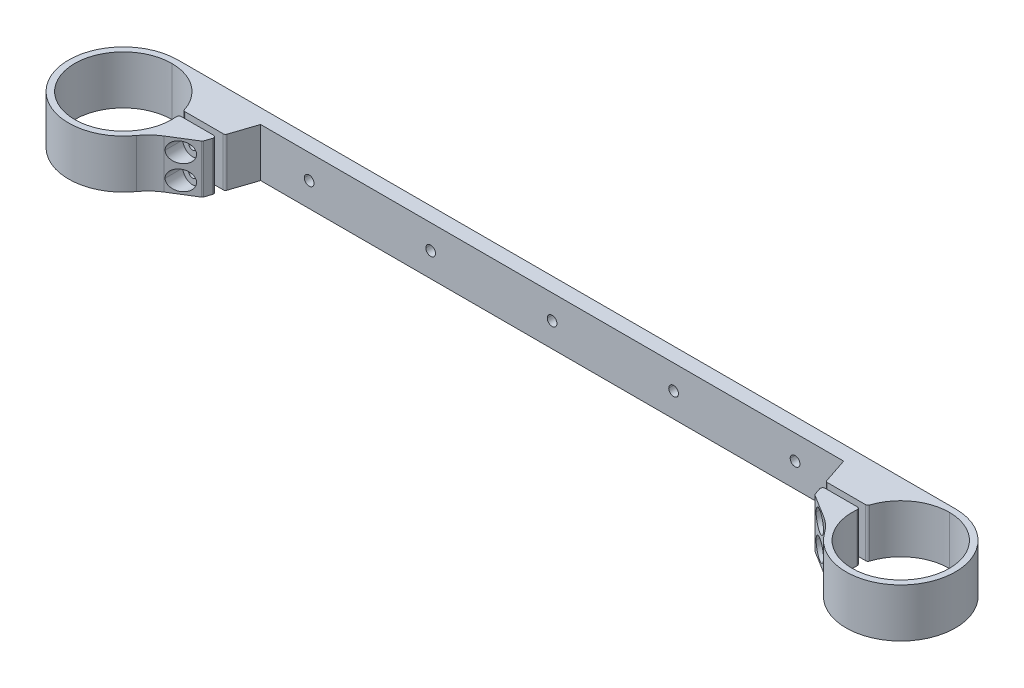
ISO-10303-21;
HEADER;
FILE_DESCRIPTION(('STEP AP214'),'2;1');
FILE_NAME('part.step','',(''),(''),'','','');
FILE_SCHEMA(('AUTOMOTIVE_DESIGN { 1 0 10303 214 1 1 1 1 }'));
ENDSEC;
DATA;
#1=APPLICATION_CONTEXT('core data for automotive mechanical design processes');
#2=APPLICATION_PROTOCOL_DEFINITION('international standard','automotive_design',2000,#1);
#3=PRODUCT_CONTEXT('',#1,'mechanical');
#4=PRODUCT('Part','Part','',(#3));
#5=PRODUCT_RELATED_PRODUCT_CATEGORY('part','',(#4));
#6=PRODUCT_DEFINITION_FORMATION('','',#4);
#7=PRODUCT_DEFINITION_CONTEXT('part definition',#1,'design');
#8=PRODUCT_DEFINITION('design','',#6,#7);
#9=PRODUCT_DEFINITION_SHAPE('','',#8);
#10=(LENGTH_UNIT() NAMED_UNIT(*) SI_UNIT(.MILLI.,.METRE.));
#11=(NAMED_UNIT(*) PLANE_ANGLE_UNIT() SI_UNIT($,.RADIAN.));
#12=(NAMED_UNIT(*) SI_UNIT($,.STERADIAN.) SOLID_ANGLE_UNIT());
#13=UNCERTAINTY_MEASURE_WITH_UNIT(LENGTH_MEASURE(1.E-05),#10,'distance_accuracy_value','');
#14=(GEOMETRIC_REPRESENTATION_CONTEXT(3) GLOBAL_UNCERTAINTY_ASSIGNED_CONTEXT((#13)) GLOBAL_UNIT_ASSIGNED_CONTEXT((#10,
#11,#12)) REPRESENTATION_CONTEXT('',''));
#15=CARTESIAN_POINT('',(0.,0.,0.));
#16=DIRECTION('',(0.,0.,1.));
#17=DIRECTION('',(1.,0.,0.));
#18=AXIS2_PLACEMENT_3D('',#15,#16,#17);
#19=CARTESIAN_POINT('',(131.5,15.,-22.5));
#20=DIRECTION('',(0.,0.,1.));
#21=DIRECTION('',(1.,0.,0.));
#22=AXIS2_PLACEMENT_3D('',#19,#20,#21);
#23=CYLINDRICAL_SURFACE('',#22,1.5);
#24=DIRECTION('',(0.,0.,1.));
#25=VECTOR('',#24,1.);
#26=CARTESIAN_POINT('',(130.,15.,-22.5));
#27=LINE('',#26,#25);
#28=CARTESIAN_POINT('',(130.,15.,-22.5));
#29=VERTEX_POINT('',#28);
#30=CARTESIAN_POINT('',(130.,15.,-5.5));
#31=VERTEX_POINT('',#30);
#32=EDGE_CURVE('E1288',#29,#31,#27,.T.);
#33=ORIENTED_EDGE('',*,*,#32,.F.);
#34=CARTESIAN_POINT('',(131.5,15.,-22.5));
#35=DIRECTION('',(0.,0.,1.));
#36=DIRECTION('',(-1.,0.,0.));
#37=AXIS2_PLACEMENT_3D('',#34,#35,#36);
#38=CIRCLE('',#37,1.5);
#39=CARTESIAN_POINT('',(133.,15.,-22.5));
#40=VERTEX_POINT('',#39);
#41=EDGE_CURVE('E1146',#40,#29,#38,.T.);
#42=ORIENTED_EDGE('',*,*,#41,.F.);
#43=DIRECTION('',(0.,0.,1.));
#44=VECTOR('',#43,1.);
#45=CARTESIAN_POINT('',(133.,15.,-22.5));
#46=LINE('',#45,#44);
#47=CARTESIAN_POINT('',(133.,15.,-5.5));
#48=VERTEX_POINT('',#47);
#49=EDGE_CURVE('E1310',#40,#48,#46,.T.);
#50=ORIENTED_EDGE('',*,*,#49,.T.);
#51=CARTESIAN_POINT('',(131.5,15.,-5.5));
#52=DIRECTION('',(0.,0.,1.));
#53=DIRECTION('',(-1.,0.,0.));
#54=AXIS2_PLACEMENT_3D('',#51,#52,#53);
#55=CIRCLE('',#54,1.5);
#56=EDGE_CURVE('E1200',#48,#31,#55,.T.);
#57=ORIENTED_EDGE('',*,*,#56,.T.);
#58=EDGE_LOOP('',(#33,#42,#50,#57));
#59=FACE_BOUND('',#58,.T.);
#60=ADVANCED_FACE('F16',(#59),#23,.F.);
#61=CARTESIAN_POINT('',(131.5,5.,-22.5));
#62=DIRECTION('',(0.,0.,1.));
#63=DIRECTION('',(1.,0.,0.));
#64=AXIS2_PLACEMENT_3D('',#61,#62,#63);
#65=CYLINDRICAL_SURFACE('',#64,1.5);
#66=DIRECTION('',(0.,0.,1.));
#67=VECTOR('',#66,1.);
#68=CARTESIAN_POINT('',(130.,5.,-22.5));
#69=LINE('',#68,#67);
#70=CARTESIAN_POINT('',(130.,5.,-22.5));
#71=VERTEX_POINT('',#70);
#72=CARTESIAN_POINT('',(130.,5.,-5.5));
#73=VERTEX_POINT('',#72);
#74=EDGE_CURVE('E1324',#71,#73,#69,.T.);
#75=ORIENTED_EDGE('',*,*,#74,.F.);
#76=CARTESIAN_POINT('',(131.5,5.,-22.5));
#77=DIRECTION('',(0.,0.,1.));
#78=DIRECTION('',(-1.,0.,0.));
#79=AXIS2_PLACEMENT_3D('',#76,#77,#78);
#80=CIRCLE('',#79,1.5);
#81=CARTESIAN_POINT('',(133.,5.,-22.5));
#82=VERTEX_POINT('',#81);
#83=EDGE_CURVE('E1149',#82,#71,#80,.T.);
#84=ORIENTED_EDGE('',*,*,#83,.F.);
#85=DIRECTION('',(0.,0.,1.));
#86=VECTOR('',#85,1.);
#87=CARTESIAN_POINT('',(133.,5.,-22.5));
#88=LINE('',#87,#86);
#89=CARTESIAN_POINT('',(133.,5.,-5.5));
#90=VERTEX_POINT('',#89);
#91=EDGE_CURVE('E599',#82,#90,#88,.T.);
#92=ORIENTED_EDGE('',*,*,#91,.T.);
#93=CARTESIAN_POINT('',(131.5,5.,-5.5));
#94=DIRECTION('',(0.,0.,1.));
#95=DIRECTION('',(-1.,0.,0.));
#96=AXIS2_PLACEMENT_3D('',#93,#94,#95);
#97=CIRCLE('',#96,1.5);
#98=EDGE_CURVE('E1203',#90,#73,#97,.T.);
#99=ORIENTED_EDGE('',*,*,#98,.T.);
#100=EDGE_LOOP('',(#75,#84,#92,#99));
#101=FACE_BOUND('',#100,.T.);
#102=ADVANCED_FACE('F1350',(#101),#65,.F.);
#103=CARTESIAN_POINT('',(-131.5,5.,-22.5));
#104=DIRECTION('',(0.,0.,1.));
#105=DIRECTION('',(1.,0.,0.));
#106=AXIS2_PLACEMENT_3D('',#103,#104,#105);
#107=CYLINDRICAL_SURFACE('',#106,1.5);
#108=DIRECTION('',(0.,0.,1.));
#109=VECTOR('',#108,1.);
#110=CARTESIAN_POINT('',(-133.,5.,-22.5));
#111=LINE('',#110,#109);
#112=CARTESIAN_POINT('',(-133.,5.,-22.5));
#113=VERTEX_POINT('',#112);
#114=CARTESIAN_POINT('',(-133.,5.,-5.5));
#115=VERTEX_POINT('',#114);
#116=EDGE_CURVE('E574',#113,#115,#111,.T.);
#117=ORIENTED_EDGE('',*,*,#116,.F.);
#118=CARTESIAN_POINT('',(-131.5,5.,-22.5));
#119=DIRECTION('',(0.,0.,1.));
#120=DIRECTION('',(1.,0.,0.));
#121=AXIS2_PLACEMENT_3D('',#118,#119,#120);
#122=CIRCLE('',#121,1.5);
#123=CARTESIAN_POINT('',(-130.,5.,-22.5));
#124=VERTEX_POINT('',#123);
#125=EDGE_CURVE('E1152',#124,#113,#122,.T.);
#126=ORIENTED_EDGE('',*,*,#125,.F.);
#127=DIRECTION('',(0.,0.,1.));
#128=VECTOR('',#127,1.);
#129=CARTESIAN_POINT('',(-130.,5.,-22.5));
#130=LINE('',#129,#128);
#131=CARTESIAN_POINT('',(-130.,5.,-5.5));
#132=VERTEX_POINT('',#131);
#133=EDGE_CURVE('E577',#124,#132,#130,.T.);
#134=ORIENTED_EDGE('',*,*,#133,.T.);
#135=CARTESIAN_POINT('',(-131.5,5.,-5.5));
#136=DIRECTION('',(0.,0.,1.));
#137=DIRECTION('',(1.,0.,0.));
#138=AXIS2_PLACEMENT_3D('',#135,#136,#137);
#139=CIRCLE('',#138,1.5);
#140=EDGE_CURVE('E570',#132,#115,#139,.T.);
#141=ORIENTED_EDGE('',*,*,#140,.T.);
#142=EDGE_LOOP('',(#117,#126,#134,#141));
#143=FACE_BOUND('',#142,.T.);
#144=ADVANCED_FACE('F572',(#143),#107,.F.);
#145=CARTESIAN_POINT('',(-131.5,15.,-22.5));
#146=DIRECTION('',(0.,0.,1.));
#147=DIRECTION('',(1.,0.,0.));
#148=AXIS2_PLACEMENT_3D('',#145,#146,#147);
#149=CYLINDRICAL_SURFACE('',#148,1.5);
#150=DIRECTION('',(0.,0.,1.));
#151=VECTOR('',#150,1.);
#152=CARTESIAN_POINT('',(-133.,15.,-22.5));
#153=LINE('',#152,#151);
#154=CARTESIAN_POINT('',(-133.,15.,-22.5));
#155=VERTEX_POINT('',#154);
#156=CARTESIAN_POINT('',(-133.,15.,-5.5));
#157=VERTEX_POINT('',#156);
#158=EDGE_CURVE('E625',#155,#157,#153,.T.);
#159=ORIENTED_EDGE('',*,*,#158,.F.);
#160=CARTESIAN_POINT('',(-131.5,15.,-22.5));
#161=DIRECTION('',(0.,0.,1.));
#162=DIRECTION('',(1.,0.,0.));
#163=AXIS2_PLACEMENT_3D('',#160,#161,#162);
#164=CIRCLE('',#163,1.5);
#165=CARTESIAN_POINT('',(-130.,15.,-22.5));
#166=VERTEX_POINT('',#165);
#167=EDGE_CURVE('E1155',#166,#155,#164,.T.);
#168=ORIENTED_EDGE('',*,*,#167,.F.);
#169=DIRECTION('',(0.,0.,1.));
#170=VECTOR('',#169,1.);
#171=CARTESIAN_POINT('',(-130.,15.,-22.5));
#172=LINE('',#171,#170);
#173=CARTESIAN_POINT('',(-130.,15.,-5.5));
#174=VERTEX_POINT('',#173);
#175=EDGE_CURVE('E624',#166,#174,#172,.T.);
#176=ORIENTED_EDGE('',*,*,#175,.T.);
#177=CARTESIAN_POINT('',(-131.5,15.,-5.5));
#178=DIRECTION('',(0.,0.,1.));
#179=DIRECTION('',(1.,0.,0.));
#180=AXIS2_PLACEMENT_3D('',#177,#178,#179);
#181=CIRCLE('',#180,1.5);
#182=EDGE_CURVE('E581',#174,#157,#181,.T.);
#183=ORIENTED_EDGE('',*,*,#182,.T.);
#184=EDGE_LOOP('',(#159,#168,#176,#183));
#185=FACE_BOUND('',#184,.T.);
#186=ADVANCED_FACE('F2119',(#185),#149,.F.);
#187=CARTESIAN_POINT('',(125.268537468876,20.,24.4943975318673));
#188=DIRECTION('',(0.,-1.,0.));
#189=DIRECTION('',(0.,0.,-1.));
#190=AXIS2_PLACEMENT_3D('',#187,#188,#189);
#191=CYLINDRICAL_SURFACE('',#190,20.);
#192=CARTESIAN_POINT('',(125.268537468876,20.,24.4943975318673));
#193=DIRECTION('',(0.,-1.,0.));
#194=DIRECTION('',(0.,0.,1.));
#195=AXIS2_PLACEMENT_3D('',#192,#193,#194);
#196=CIRCLE('',#195,20.);
#197=CARTESIAN_POINT('',(135.809463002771,20.,7.49766581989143));
#198=VERTEX_POINT('',#197);
#199=CARTESIAN_POINT('',(141.612755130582,20.,12.9676222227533));
#200=VERTEX_POINT('',#199);
#201=EDGE_CURVE('E1014',#198,#200,#196,.T.);
#202=ORIENTED_EDGE('',*,*,#201,.F.);
#203=DIRECTION('',(0.,1.,0.));
#204=VECTOR('',#203,1.);
#205=CARTESIAN_POINT('',(135.809463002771,20.,7.49766581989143));
#206=LINE('',#205,#204);
#207=CARTESIAN_POINT('',(135.809463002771,0.,7.49766581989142));
#208=VERTEX_POINT('',#207);
#209=EDGE_CURVE('E781',#208,#198,#206,.T.);
#210=ORIENTED_EDGE('',*,*,#209,.F.);
#211=CARTESIAN_POINT('',(125.268537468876,0.,24.4943975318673));
#212=DIRECTION('',(0.,1.,0.));
#213=DIRECTION('',(0.,0.,1.));
#214=AXIS2_PLACEMENT_3D('',#211,#212,#213);
#215=CIRCLE('',#214,20.);
#216=CARTESIAN_POINT('',(141.612755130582,0.,12.9676222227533));
#217=VERTEX_POINT('',#216);
#218=EDGE_CURVE('E1104',#217,#208,#215,.T.);
#219=ORIENTED_EDGE('',*,*,#218,.F.);
#220=DIRECTION('',(0.,-1.,0.));
#221=VECTOR('',#220,1.);
#222=CARTESIAN_POINT('',(141.612755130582,20.,12.9676222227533));
#223=LINE('',#222,#221);
#224=EDGE_CURVE('E1059',#200,#217,#223,.T.);
#225=ORIENTED_EDGE('',*,*,#224,.F.);
#226=EDGE_LOOP('',(#202,#210,#219,#225));
#227=FACE_BOUND('',#226,.T.);
#228=ADVANCED_FACE('F1458',(#227),#191,.F.);
#229=CARTESIAN_POINT('',(-126.79824142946,20.,0.732446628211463));
#230=DIRECTION('',(0.,-1.,0.));
#231=DIRECTION('',(0.,0.,-1.));
#232=AXIS2_PLACEMENT_3D('',#229,#230,#231);
#233=CYLINDRICAL_SURFACE('',#232,1.);
#234=CARTESIAN_POINT('',(-126.79824142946,20.,0.732446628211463));
#235=DIRECTION('',(0.,1.,0.));
#236=DIRECTION('',(0.,0.,1.));
#237=AXIS2_PLACEMENT_3D('',#234,#235,#236);
#238=CIRCLE('',#237,1.);
#239=CARTESIAN_POINT('',(-126.271195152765,20.,1.58228321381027));
#240=VERTEX_POINT('',#239);
#241=CARTESIAN_POINT('',(-125.849558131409,20.,1.0486743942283));
#242=VERTEX_POINT('',#241);
#243=EDGE_CURVE('E1029',#240,#242,#238,.T.);
#244=ORIENTED_EDGE('',*,*,#243,.F.);
#245=DIRECTION('',(0.,1.,0.));
#246=VECTOR('',#245,1.);
#247=CARTESIAN_POINT('',(-126.271195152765,20.,1.58228321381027));
#248=LINE('',#247,#246);
#249=CARTESIAN_POINT('',(-126.271195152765,0.,1.58228321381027));
#250=VERTEX_POINT('',#249);
#251=EDGE_CURVE('E1159',#250,#240,#248,.T.);
#252=ORIENTED_EDGE('',*,*,#251,.F.);
#253=CARTESIAN_POINT('',(-126.79824142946,0.,0.732446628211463));
#254=DIRECTION('',(0.,-1.,0.));
#255=DIRECTION('',(0.,0.,1.));
#256=AXIS2_PLACEMENT_3D('',#253,#254,#255);
#257=CIRCLE('',#256,1.);
#258=CARTESIAN_POINT('',(-125.849558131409,0.,1.0486743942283));
#259=VERTEX_POINT('',#258);
#260=EDGE_CURVE('E1080',#259,#250,#257,.T.);
#261=ORIENTED_EDGE('',*,*,#260,.F.);
#262=DIRECTION('',(0.,-1.,0.));
#263=VECTOR('',#262,1.);
#264=CARTESIAN_POINT('',(-125.849558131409,20.,1.0486743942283));
#265=LINE('',#264,#263);
#266=EDGE_CURVE('E1124',#242,#259,#265,.T.);
#267=ORIENTED_EDGE('',*,*,#266,.F.);
#268=EDGE_LOOP('',(#244,#252,#261,#267));
#269=FACE_BOUND('',#268,.T.);
#270=ADVANCED_FACE('F1433',(#269),#233,.T.);
#271=CARTESIAN_POINT('',(126.79824142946,20.,0.732446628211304));
#272=DIRECTION('',(0.,1.,0.));
#273=DIRECTION('',(0.,0.,1.));
#274=AXIS2_PLACEMENT_3D('',#271,#272,#273);
#275=CYLINDRICAL_SURFACE('',#274,1.);
#276=CARTESIAN_POINT('',(126.79824142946,0.,0.732446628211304));
#277=DIRECTION('',(0.,-1.,0.));
#278=DIRECTION('',(0.,0.,1.));
#279=AXIS2_PLACEMENT_3D('',#276,#277,#278);
#280=CIRCLE('',#279,1.);
#281=CARTESIAN_POINT('',(126.271195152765,0.,1.58228321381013));
#282=VERTEX_POINT('',#281);
#283=CARTESIAN_POINT('',(125.849558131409,0.,1.04867439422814));
#284=VERTEX_POINT('',#283);
#285=EDGE_CURVE('E675',#282,#284,#280,.T.);
#286=ORIENTED_EDGE('',*,*,#285,.F.);
#287=DIRECTION('',(0.,-1.,0.));
#288=VECTOR('',#287,1.);
#289=CARTESIAN_POINT('',(126.271195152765,20.,1.5822832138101));
#290=LINE('',#289,#288);
#291=CARTESIAN_POINT('',(126.271195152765,20.,1.5822832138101));
#292=VERTEX_POINT('',#291);
#293=EDGE_CURVE('E1253',#292,#282,#290,.T.);
#294=ORIENTED_EDGE('',*,*,#293,.F.);
#295=CARTESIAN_POINT('',(126.79824142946,20.,0.732446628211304));
#296=DIRECTION('',(0.,1.,0.));
#297=DIRECTION('',(0.,0.,1.));
#298=AXIS2_PLACEMENT_3D('',#295,#296,#297);
#299=CIRCLE('',#298,1.);
#300=CARTESIAN_POINT('',(125.849558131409,20.,1.04867439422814));
#301=VERTEX_POINT('',#300);
#302=EDGE_CURVE('E1009',#301,#292,#299,.T.);
#303=ORIENTED_EDGE('',*,*,#302,.F.);
#304=DIRECTION('',(0.,1.,0.));
#305=VECTOR('',#304,1.);
#306=CARTESIAN_POINT('',(125.849558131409,20.,1.04867439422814));
#307=LINE('',#306,#305);
#308=EDGE_CURVE('E48',#284,#301,#307,.T.);
#309=ORIENTED_EDGE('',*,*,#308,.F.);
#310=EDGE_LOOP('',(#286,#294,#303,#309));
#311=FACE_BOUND('',#310,.T.);
#312=ADVANCED_FACE('F1463',(#311),#275,.T.);
#313=CARTESIAN_POINT('',(125.887425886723,20.,-2.));
#314=DIRECTION('',(0.,-1.,0.));
#315=DIRECTION('',(0.,0.,-1.));
#316=AXIS2_PLACEMENT_3D('',#313,#314,#315);
#317=CYLINDRICAL_SURFACE('',#316,1.);
#318=CARTESIAN_POINT('',(125.887425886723,20.,-2.));
#319=DIRECTION('',(0.,1.,0.));
#320=DIRECTION('',(0.,0.,1.));
#321=AXIS2_PLACEMENT_3D('',#318,#319,#320);
#322=CIRCLE('',#321,1.);
#323=CARTESIAN_POINT('',(125.887425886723,20.,-3.));
#324=VERTEX_POINT('',#323);
#325=CARTESIAN_POINT('',(124.938742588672,20.,-1.68377223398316));
#326=VERTEX_POINT('',#325);
#327=EDGE_CURVE('E978',#324,#326,#322,.T.);
#328=ORIENTED_EDGE('',*,*,#327,.F.);
#329=DIRECTION('',(0.,1.,0.));
#330=VECTOR('',#329,1.);
#331=CARTESIAN_POINT('',(125.887425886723,-40.,-3.));
#332=LINE('',#331,#330);
#333=CARTESIAN_POINT('',(125.887425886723,0.,-3.));
#334=VERTEX_POINT('',#333);
#335=EDGE_CURVE('E800',#334,#324,#332,.T.);
#336=ORIENTED_EDGE('',*,*,#335,.F.);
#337=CARTESIAN_POINT('',(125.887425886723,0.,-2.));
#338=DIRECTION('',(0.,-1.,0.));
#339=DIRECTION('',(0.,0.,1.));
#340=AXIS2_PLACEMENT_3D('',#337,#338,#339);
#341=CIRCLE('',#340,1.);
#342=CARTESIAN_POINT('',(124.938742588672,0.,-1.68377223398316));
#343=VERTEX_POINT('',#342);
#344=EDGE_CURVE('E1114',#343,#334,#341,.T.);
#345=ORIENTED_EDGE('',*,*,#344,.F.);
#346=DIRECTION('',(0.,-1.,0.));
#347=VECTOR('',#346,1.);
#348=CARTESIAN_POINT('',(124.938742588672,20.,-1.68377223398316));
#349=LINE('',#348,#347);
#350=EDGE_CURVE('E37',#326,#343,#349,.T.);
#351=ORIENTED_EDGE('',*,*,#350,.F.);
#352=EDGE_LOOP('',(#328,#336,#345,#351));
#353=FACE_BOUND('',#352,.T.);
#354=ADVANCED_FACE('F1592',(#353),#317,.T.);
#355=CARTESIAN_POINT('',(124.387425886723,20.,-6.5));
#356=DIRECTION('',(0.,1.,0.));
#357=DIRECTION('',(0.,0.,1.));
#358=AXIS2_PLACEMENT_3D('',#355,#356,#357);
#359=CYLINDRICAL_SURFACE('',#358,1.);
#360=CARTESIAN_POINT('',(124.387425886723,0.,-6.5));
#361=DIRECTION('',(0.,-1.,0.));
#362=DIRECTION('',(0.,0.,1.));
#363=AXIS2_PLACEMENT_3D('',#360,#361,#362);
#364=CIRCLE('',#363,1.);
#365=CARTESIAN_POINT('',(124.387425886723,0.,-5.5));
#366=VERTEX_POINT('',#365);
#367=CARTESIAN_POINT('',(123.438742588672,0.,-6.18377223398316));
#368=VERTEX_POINT('',#367);
#369=EDGE_CURVE('E684',#366,#368,#364,.T.);
#370=ORIENTED_EDGE('',*,*,#369,.F.);
#371=DIRECTION('',(0.,-1.,0.));
#372=VECTOR('',#371,1.);
#373=CARTESIAN_POINT('',(124.387425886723,-40.,-5.5));
#374=LINE('',#373,#372);
#375=CARTESIAN_POINT('',(124.387425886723,20.,-5.5));
#376=VERTEX_POINT('',#375);
#377=EDGE_CURVE('E1197',#376,#366,#374,.T.);
#378=ORIENTED_EDGE('',*,*,#377,.F.);
#379=CARTESIAN_POINT('',(124.387425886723,20.,-6.5));
#380=DIRECTION('',(0.,1.,0.));
#381=DIRECTION('',(0.,0.,1.));
#382=AXIS2_PLACEMENT_3D('',#379,#380,#381);
#383=CIRCLE('',#382,1.);
#384=CARTESIAN_POINT('',(123.438742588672,20.,-6.18377223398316));
#385=VERTEX_POINT('',#384);
#386=EDGE_CURVE('E924',#385,#376,#383,.T.);
#387=ORIENTED_EDGE('',*,*,#386,.F.);
#388=DIRECTION('',(0.,1.,0.));
#389=VECTOR('',#388,1.);
#390=CARTESIAN_POINT('',(123.438742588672,20.,-6.18377223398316));
#391=LINE('',#390,#389);
#392=EDGE_CURVE('E995',#368,#385,#391,.T.);
#393=ORIENTED_EDGE('',*,*,#392,.F.);
#394=EDGE_LOOP('',(#370,#378,#387,#393));
#395=FACE_BOUND('',#394,.T.);
#396=ADVANCED_FACE('F1381',(#395),#359,.T.);
#397=CARTESIAN_POINT('',(140.031274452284,20.,-6.5));
#398=DIRECTION('',(0.,-1.,0.));
#399=DIRECTION('',(0.,0.,-1.));
#400=AXIS2_PLACEMENT_3D('',#397,#398,#399);
#401=CYLINDRICAL_SURFACE('',#400,1.);
#402=CARTESIAN_POINT('',(140.031274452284,0.,-6.5));
#403=DIRECTION('',(0.,-1.,0.));
#404=DIRECTION('',(0.,0.,1.));
#405=AXIS2_PLACEMENT_3D('',#402,#403,#404);
#406=CIRCLE('',#405,1.);
#407=CARTESIAN_POINT('',(140.982166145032,0.,-6.19047619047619));
#408=VERTEX_POINT('',#407);
#409=CARTESIAN_POINT('',(140.031274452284,0.,-5.5));
#410=VERTEX_POINT('',#409);
#411=EDGE_CURVE('E614',#408,#410,#406,.T.);
#412=ORIENTED_EDGE('',*,*,#411,.F.);
#413=DIRECTION('',(0.,-1.,0.));
#414=VECTOR('',#413,1.);
#415=CARTESIAN_POINT('',(140.982166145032,20.,-6.19047619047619));
#416=LINE('',#415,#414);
#417=CARTESIAN_POINT('',(140.982166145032,20.,-6.19047619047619));
#418=VERTEX_POINT('',#417);
#419=EDGE_CURVE('E801',#418,#408,#416,.T.);
#420=ORIENTED_EDGE('',*,*,#419,.F.);
#421=CARTESIAN_POINT('',(140.031274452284,20.,-6.5));
#422=DIRECTION('',(0.,1.,0.));
#423=DIRECTION('',(0.,0.,1.));
#424=AXIS2_PLACEMENT_3D('',#421,#422,#423);
#425=CIRCLE('',#424,1.);
#426=CARTESIAN_POINT('',(140.031274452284,20.,-5.5));
#427=VERTEX_POINT('',#426);
#428=EDGE_CURVE('E985',#427,#418,#425,.T.);
#429=ORIENTED_EDGE('',*,*,#428,.F.);
#430=DIRECTION('',(0.,1.,0.));
#431=VECTOR('',#430,1.);
#432=CARTESIAN_POINT('',(140.031274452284,20.,-5.5));
#433=LINE('',#432,#431);
#434=EDGE_CURVE('E1194',#410,#427,#433,.T.);
#435=ORIENTED_EDGE('',*,*,#434,.F.);
#436=EDGE_LOOP('',(#412,#420,#429,#435));
#437=FACE_BOUND('',#436,.T.);
#438=ADVANCED_FACE('F1373',(#437),#401,.T.);
#439=CARTESIAN_POINT('',(139.095455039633,20.,-2.));
#440=DIRECTION('',(0.,-1.,0.));
#441=DIRECTION('',(0.,0.,-1.));
#442=AXIS2_PLACEMENT_3D('',#439,#440,#441);
#443=CYLINDRICAL_SURFACE('',#442,1.);
#444=CARTESIAN_POINT('',(139.095455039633,20.,-2.));
#445=DIRECTION('',(0.,1.,0.));
#446=DIRECTION('',(0.,0.,1.));
#447=AXIS2_PLACEMENT_3D('',#444,#445,#446);
#448=CIRCLE('',#447,1.);
#449=CARTESIAN_POINT('',(140.090909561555,20.,-1.9047619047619));
#450=VERTEX_POINT('',#449);
#451=CARTESIAN_POINT('',(139.095455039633,20.,-3.));
#452=VERTEX_POINT('',#451);
#453=EDGE_CURVE('E731',#450,#452,#448,.T.);
#454=ORIENTED_EDGE('',*,*,#453,.F.);
#455=DIRECTION('',(0.,1.,0.));
#456=VECTOR('',#455,1.);
#457=CARTESIAN_POINT('',(140.090909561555,20.,-1.9047619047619));
#458=LINE('',#457,#456);
#459=CARTESIAN_POINT('',(140.090909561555,0.,-1.9047619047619));
#460=VERTEX_POINT('',#459);
#461=EDGE_CURVE('E661',#460,#450,#458,.T.);
#462=ORIENTED_EDGE('',*,*,#461,.F.);
#463=CARTESIAN_POINT('',(139.095455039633,0.,-2.));
#464=DIRECTION('',(0.,-1.,0.));
#465=DIRECTION('',(0.,0.,1.));
#466=AXIS2_PLACEMENT_3D('',#463,#464,#465);
#467=CIRCLE('',#466,1.);
#468=CARTESIAN_POINT('',(139.095455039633,0.,-3.));
#469=VERTEX_POINT('',#468);
#470=EDGE_CURVE('E632',#469,#460,#467,.T.);
#471=ORIENTED_EDGE('',*,*,#470,.F.);
#472=DIRECTION('',(0.,-1.,0.));
#473=VECTOR('',#472,1.);
#474=CARTESIAN_POINT('',(139.095455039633,0.,-3.));
#475=LINE('',#474,#473);
#476=EDGE_CURVE('E797',#452,#469,#475,.T.);
#477=ORIENTED_EDGE('',*,*,#476,.F.);
#478=EDGE_LOOP('',(#454,#462,#471,#477));
#479=FACE_BOUND('',#478,.T.);
#480=ADVANCED_FACE('F1515',(#479),#443,.T.);
#481=CARTESIAN_POINT('',(131.5,15.,13.));
#482=DIRECTION('',(0.,0.,-1.));
#483=DIRECTION('',(-1.,0.,0.));
#484=AXIS2_PLACEMENT_3D('',#481,#482,#483);
#485=CYLINDRICAL_SURFACE('',#484,4.);
#486=DIRECTION('',(0.,0.,-1.));
#487=VECTOR('',#486,1.);
#488=CARTESIAN_POINT('',(135.5,15.,13.));
#489=LINE('',#488,#487);
#490=CARTESIAN_POINT('',(135.5,15.,7.30574501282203));
#491=VERTEX_POINT('',#490);
#492=CARTESIAN_POINT('',(135.5,15.,0.));
#493=VERTEX_POINT('',#492);
#494=EDGE_CURVE('E638',#491,#493,#489,.T.);
#495=ORIENTED_EDGE('',*,*,#494,.F.);
#496=CARTESIAN_POINT('',(135.5,15.,7.30574501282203));
#497=CARTESIAN_POINT('',(135.5,23.,7.30574501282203));
#498=CARTESIAN_POINT('',(127.5,23.,2.34435562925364));
#499=CARTESIAN_POINT('',(127.5,15.,2.34435562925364));
#500=(BOUNDED_CURVE() B_SPLINE_CURVE(3,(#496,#497,#498,#499),.UNSPECIFIED.,.F.,
.F.) B_SPLINE_CURVE_WITH_KNOTS((4,4),(3.1415926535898,6.28318530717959),
.UNSPECIFIED.) CURVE() GEOMETRIC_REPRESENTATION_ITEM() RATIONAL_B_SPLINE_CURVE((1.,
0.333333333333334,0.333333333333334,1.)) REPRESENTATION_ITEM(''));
#501=CARTESIAN_POINT('',(127.5,15.,2.34435562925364));
#502=VERTEX_POINT('',#501);
#503=EDGE_CURVE('E1255',#491,#502,#500,.T.);
#504=ORIENTED_EDGE('',*,*,#503,.T.);
#505=DIRECTION('',(0.,0.,-1.));
#506=VECTOR('',#505,1.);
#507=CARTESIAN_POINT('',(127.5,15.,13.));
#508=LINE('',#507,#506);
#509=CARTESIAN_POINT('',(127.5,15.,0.));
#510=VERTEX_POINT('',#509);
#511=EDGE_CURVE('E652',#502,#510,#508,.T.);
#512=ORIENTED_EDGE('',*,*,#511,.T.);
#513=CARTESIAN_POINT('',(131.5,15.,0.));
#514=DIRECTION('',(0.,0.,1.));
#515=DIRECTION('',(1.,0.,0.));
#516=AXIS2_PLACEMENT_3D('',#513,#514,#515);
#517=CIRCLE('',#516,4.);
#518=EDGE_CURVE('E10',#493,#510,#517,.T.);
#519=ORIENTED_EDGE('',*,*,#518,.F.);
#520=EDGE_LOOP('',(#495,#504,#512,#519));
#521=FACE_BOUND('',#520,.T.);
#522=ADVANCED_FACE('F1555',(#521),#485,.F.);
#523=CARTESIAN_POINT('',(131.5,15.,0.));
#524=DIRECTION('',(0.,0.,-1.));
#525=DIRECTION('',(0.,-1.,0.));
#526=AXIS2_PLACEMENT_3D('',#523,#524,#525);
#527=PLANE('',#526);
#528=CARTESIAN_POINT('',(131.5,15.,0.));
#529=DIRECTION('',(0.,0.,1.));
#530=DIRECTION('',(-1.,0.,0.));
#531=AXIS2_PLACEMENT_3D('',#528,#529,#530);
#532=CIRCLE('',#531,1.6);
#533=CARTESIAN_POINT('',(133.1,15.,0.));
#534=VERTEX_POINT('',#533);
#535=CARTESIAN_POINT('',(129.9,15.,0.));
#536=VERTEX_POINT('',#535);
#537=EDGE_CURVE('E1163',#534,#536,#532,.T.);
#538=ORIENTED_EDGE('',*,*,#537,.F.);
#539=CARTESIAN_POINT('',(131.5,15.,0.));
#540=DIRECTION('',(0.,0.,1.));
#541=DIRECTION('',(-1.,0.,0.));
#542=AXIS2_PLACEMENT_3D('',#539,#540,#541);
#543=CIRCLE('',#542,1.6);
#544=EDGE_CURVE('E836',#536,#534,#543,.T.);
#545=ORIENTED_EDGE('',*,*,#544,.F.);
#546=EDGE_LOOP('',(#538,#545));
#547=FACE_BOUND('',#546,.T.);
#548=CARTESIAN_POINT('',(131.5,15.,0.));
#549=DIRECTION('',(0.,0.,1.));
#550=DIRECTION('',(1.,0.,0.));
#551=AXIS2_PLACEMENT_3D('',#548,#549,#550);
#552=CIRCLE('',#551,4.);
#553=EDGE_CURVE('E645',#510,#493,#552,.T.);
#554=ORIENTED_EDGE('',*,*,#553,.T.);
#555=ORIENTED_EDGE('',*,*,#518,.T.);
#556=EDGE_LOOP('',(#554,#555));
#557=FACE_BOUND('',#556,.T.);
#558=ADVANCED_FACE('F1558',(#547,#557),#527,.F.);
#559=CARTESIAN_POINT('',(131.5,5.,13.));
#560=DIRECTION('',(0.,0.,-1.));
#561=DIRECTION('',(-1.,0.,0.));
#562=AXIS2_PLACEMENT_3D('',#559,#560,#561);
#563=CYLINDRICAL_SURFACE('',#562,4.);
#564=DIRECTION('',(0.,0.,-1.));
#565=VECTOR('',#564,1.);
#566=CARTESIAN_POINT('',(135.5,5.,13.));
#567=LINE('',#566,#565);
#568=CARTESIAN_POINT('',(135.5,5.,7.30574501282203));
#569=VERTEX_POINT('',#568);
#570=CARTESIAN_POINT('',(135.5,5.,0.));
#571=VERTEX_POINT('',#570);
#572=EDGE_CURVE('E667',#569,#571,#567,.T.);
#573=ORIENTED_EDGE('',*,*,#572,.F.);
#574=CARTESIAN_POINT('',(135.5,5.,7.30574501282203));
#575=CARTESIAN_POINT('',(135.5,13.,7.30574501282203));
#576=CARTESIAN_POINT('',(127.5,13.,2.34435562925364));
#577=CARTESIAN_POINT('',(127.5,5.,2.34435562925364));
#578=(BOUNDED_CURVE() B_SPLINE_CURVE(3,(#574,#575,#576,#577),.UNSPECIFIED.,.F.,
.F.) B_SPLINE_CURVE_WITH_KNOTS((4,4),(3.1415926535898,6.28318530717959),
.UNSPECIFIED.) CURVE() GEOMETRIC_REPRESENTATION_ITEM() RATIONAL_B_SPLINE_CURVE((1.,
0.333333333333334,0.333333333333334,1.)) REPRESENTATION_ITEM(''));
#579=CARTESIAN_POINT('',(127.5,5.,2.34435562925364));
#580=VERTEX_POINT('',#579);
#581=EDGE_CURVE('E807',#569,#580,#578,.T.);
#582=ORIENTED_EDGE('',*,*,#581,.T.);
#583=DIRECTION('',(0.,0.,-1.));
#584=VECTOR('',#583,1.);
#585=CARTESIAN_POINT('',(127.5,5.,13.));
#586=LINE('',#585,#584);
#587=CARTESIAN_POINT('',(127.5,5.,0.));
#588=VERTEX_POINT('',#587);
#589=EDGE_CURVE('E688',#580,#588,#586,.T.);
#590=ORIENTED_EDGE('',*,*,#589,.T.);
#591=CARTESIAN_POINT('',(131.5,5.,0.));
#592=DIRECTION('',(0.,0.,1.));
#593=DIRECTION('',(1.,0.,0.));
#594=AXIS2_PLACEMENT_3D('',#591,#592,#593);
#595=CIRCLE('',#594,4.);
#596=EDGE_CURVE('E24',#571,#588,#595,.T.);
#597=ORIENTED_EDGE('',*,*,#596,.F.);
#598=EDGE_LOOP('',(#573,#582,#590,#597));
#599=FACE_BOUND('',#598,.T.);
#600=ADVANCED_FACE('F2036',(#599),#563,.F.);
#601=CARTESIAN_POINT('',(131.5,5.,0.));
#602=DIRECTION('',(0.,0.,-1.));
#603=DIRECTION('',(0.,-1.,0.));
#604=AXIS2_PLACEMENT_3D('',#601,#602,#603);
#605=PLANE('',#604);
#606=CARTESIAN_POINT('',(131.5,5.,0.));
#607=DIRECTION('',(0.,0.,1.));
#608=DIRECTION('',(-1.,0.,0.));
#609=AXIS2_PLACEMENT_3D('',#606,#607,#608);
#610=CIRCLE('',#609,1.6);
#611=CARTESIAN_POINT('',(133.1,5.,0.));
#612=VERTEX_POINT('',#611);
#613=CARTESIAN_POINT('',(129.9,5.,0.));
#614=VERTEX_POINT('',#613);
#615=EDGE_CURVE('E1226',#612,#614,#610,.T.);
#616=ORIENTED_EDGE('',*,*,#615,.F.);
#617=CARTESIAN_POINT('',(131.5,5.,0.));
#618=DIRECTION('',(0.,0.,1.));
#619=DIRECTION('',(-1.,0.,0.));
#620=AXIS2_PLACEMENT_3D('',#617,#618,#619);
#621=CIRCLE('',#620,1.6);
#622=EDGE_CURVE('E719',#614,#612,#621,.T.);
#623=ORIENTED_EDGE('',*,*,#622,.F.);
#624=EDGE_LOOP('',(#616,#623));
#625=FACE_BOUND('',#624,.T.);
#626=CARTESIAN_POINT('',(131.5,5.,0.));
#627=DIRECTION('',(0.,0.,1.));
#628=DIRECTION('',(1.,0.,0.));
#629=AXIS2_PLACEMENT_3D('',#626,#627,#628);
#630=CIRCLE('',#629,4.);
#631=EDGE_CURVE('E674',#588,#571,#630,.T.);
#632=ORIENTED_EDGE('',*,*,#631,.T.);
#633=ORIENTED_EDGE('',*,*,#596,.T.);
#634=EDGE_LOOP('',(#632,#633));
#635=FACE_BOUND('',#634,.T.);
#636=ADVANCED_FACE('F1543',(#625,#635),#605,.F.);
#637=CARTESIAN_POINT('',(139.844355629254,20.,10.0000000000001));
#638=DIRECTION('',(0.527046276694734,0.,-0.849836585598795));
#639=DIRECTION('',(0.,-1.,0.));
#640=AXIS2_PLACEMENT_3D('',#637,#638,#639);
#641=PLANE('',#640);
#642=CARTESIAN_POINT('',(127.5,5.,2.34435562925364));
#643=CARTESIAN_POINT('',(127.5,-3.,2.34435562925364));
#644=CARTESIAN_POINT('',(135.5,-3.,7.30574501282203));
#645=CARTESIAN_POINT('',(135.5,5.,7.30574501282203));
#646=(BOUNDED_CURVE() B_SPLINE_CURVE(3,(#642,#643,#644,#645),.UNSPECIFIED.,.F.,
.F.) B_SPLINE_CURVE_WITH_KNOTS((4,4),(0.,3.1415926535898),
.UNSPECIFIED.) CURVE() GEOMETRIC_REPRESENTATION_ITEM() RATIONAL_B_SPLINE_CURVE((1.,
0.333333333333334,0.333333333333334,1.)) REPRESENTATION_ITEM(''));
#647=EDGE_CURVE('E656',#580,#569,#646,.T.);
#648=ORIENTED_EDGE('',*,*,#647,.F.);
#649=ORIENTED_EDGE('',*,*,#581,.F.);
#650=EDGE_LOOP('',(#648,#649));
#651=FACE_BOUND('',#650,.T.);
#652=CARTESIAN_POINT('',(127.5,15.,2.34435562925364));
#653=CARTESIAN_POINT('',(127.5,7.00000000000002,2.34435562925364));
#654=CARTESIAN_POINT('',(135.5,7.00000000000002,7.30574501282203));
#655=CARTESIAN_POINT('',(135.5,15.,7.30574501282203));
#656=(BOUNDED_CURVE() B_SPLINE_CURVE(3,(#652,#653,#654,#655),.UNSPECIFIED.,.F.,
.F.) B_SPLINE_CURVE_WITH_KNOTS((4,4),(0.,3.1415926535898),
.UNSPECIFIED.) CURVE() GEOMETRIC_REPRESENTATION_ITEM() RATIONAL_B_SPLINE_CURVE((1.,
0.333333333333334,0.333333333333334,1.)) REPRESENTATION_ITEM(''));
#657=EDGE_CURVE('E629',#502,#491,#656,.T.);
#658=ORIENTED_EDGE('',*,*,#657,.F.);
#659=ORIENTED_EDGE('',*,*,#503,.F.);
#660=EDGE_LOOP('',(#658,#659));
#661=FACE_BOUND('',#660,.T.);
#662=DIRECTION('',(-0.849836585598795,0.,-0.527046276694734));
#663=VECTOR('',#662,1.);
#664=CARTESIAN_POINT('',(-81.1889332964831,0.,-127.079026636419));
#665=LINE('',#664,#663);
#666=EDGE_CURVE('E680',#208,#282,#665,.T.);
#667=ORIENTED_EDGE('',*,*,#666,.F.);
#668=ORIENTED_EDGE('',*,*,#209,.T.);
#669=DIRECTION('',(0.849836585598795,0.,0.527046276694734));
#670=VECTOR('',#669,1.);
#671=CARTESIAN_POINT('',(139.844355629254,20.,10.0000000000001));
#672=LINE('',#671,#670);
#673=EDGE_CURVE('E1013',#292,#198,#672,.T.);
#674=ORIENTED_EDGE('',*,*,#673,.F.);
#675=ORIENTED_EDGE('',*,*,#293,.T.);
#676=EDGE_LOOP('',(#667,#668,#674,#675));
#677=FACE_BOUND('',#676,.T.);
#678=ADVANCED_FACE('F1462',(#651,#661,#677),#641,.F.);
#679=CARTESIAN_POINT('',(-125.887425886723,20.,-2.));
#680=DIRECTION('',(0.,1.,0.));
#681=DIRECTION('',(0.,0.,1.));
#682=AXIS2_PLACEMENT_3D('',#679,#680,#681);
#683=CYLINDRICAL_SURFACE('',#682,1.);
#684=CARTESIAN_POINT('',(-125.887425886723,0.,-2.));
#685=DIRECTION('',(0.,-1.,0.));
#686=DIRECTION('',(0.,0.,1.));
#687=AXIS2_PLACEMENT_3D('',#684,#685,#686);
#688=CIRCLE('',#687,1.);
#689=CARTESIAN_POINT('',(-125.887425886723,0.,-3.));
#690=VERTEX_POINT('',#689);
#691=CARTESIAN_POINT('',(-124.938742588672,0.,-1.68377223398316));
#692=VERTEX_POINT('',#691);
#693=EDGE_CURVE('E1072',#690,#692,#688,.T.);
#694=ORIENTED_EDGE('',*,*,#693,.F.);
#695=DIRECTION('',(0.,-1.,0.));
#696=VECTOR('',#695,1.);
#697=CARTESIAN_POINT('',(-125.887425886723,-40.,-3.));
#698=LINE('',#697,#696);
#699=CARTESIAN_POINT('',(-125.887425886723,20.,-3.));
#700=VERTEX_POINT('',#699);
#701=EDGE_CURVE('E1054',#700,#690,#698,.T.);
#702=ORIENTED_EDGE('',*,*,#701,.F.);
#703=CARTESIAN_POINT('',(-125.887425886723,20.,-2.));
#704=DIRECTION('',(0.,1.,0.));
#705=DIRECTION('',(0.,0.,1.));
#706=AXIS2_PLACEMENT_3D('',#703,#704,#705);
#707=CIRCLE('',#706,1.);
#708=CARTESIAN_POINT('',(-124.938742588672,20.,-1.68377223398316));
#709=VERTEX_POINT('',#708);
#710=EDGE_CURVE('E1038',#709,#700,#707,.T.);
#711=ORIENTED_EDGE('',*,*,#710,.F.);
#712=DIRECTION('',(0.,1.,0.));
#713=VECTOR('',#712,1.);
#714=CARTESIAN_POINT('',(-124.938742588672,20.,-1.68377223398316));
#715=LINE('',#714,#713);
#716=EDGE_CURVE('E1125',#692,#709,#715,.T.);
#717=ORIENTED_EDGE('',*,*,#716,.F.);
#718=EDGE_LOOP('',(#694,#702,#711,#717));
#719=FACE_BOUND('',#718,.T.);
#720=ADVANCED_FACE('F1425',(#719),#683,.T.);
#721=CARTESIAN_POINT('',(-124.387425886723,20.,-6.5));
#722=DIRECTION('',(0.,-1.,0.));
#723=DIRECTION('',(0.,0.,-1.));
#724=AXIS2_PLACEMENT_3D('',#721,#722,#723);
#725=CYLINDRICAL_SURFACE('',#724,1.);
#726=CARTESIAN_POINT('',(-124.387425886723,20.,-6.5));
#727=DIRECTION('',(0.,1.,0.));
#728=DIRECTION('',(0.,0.,1.));
#729=AXIS2_PLACEMENT_3D('',#726,#727,#728);
#730=CIRCLE('',#729,1.);
#731=CARTESIAN_POINT('',(-124.387425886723,20.,-5.5));
#732=VERTEX_POINT('',#731);
#733=CARTESIAN_POINT('',(-123.438742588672,20.,-6.18377223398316));
#734=VERTEX_POINT('',#733);
#735=EDGE_CURVE('E832',#732,#734,#730,.T.);
#736=ORIENTED_EDGE('',*,*,#735,.F.);
#737=DIRECTION('',(0.,1.,0.));
#738=VECTOR('',#737,1.);
#739=CARTESIAN_POINT('',(-124.387425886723,-40.,-5.5));
#740=LINE('',#739,#738);
#741=CARTESIAN_POINT('',(-124.387425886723,0.,-5.5));
#742=VERTEX_POINT('',#741);
#743=EDGE_CURVE('E582',#742,#732,#740,.T.);
#744=ORIENTED_EDGE('',*,*,#743,.F.);
#745=CARTESIAN_POINT('',(-124.387425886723,0.,-6.5));
#746=DIRECTION('',(0.,-1.,0.));
#747=DIRECTION('',(0.,0.,1.));
#748=AXIS2_PLACEMENT_3D('',#745,#746,#747);
#749=CIRCLE('',#748,1.);
#750=CARTESIAN_POINT('',(-123.438742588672,0.,-6.18377223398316));
#751=VERTEX_POINT('',#750);
#752=EDGE_CURVE('E912',#751,#742,#749,.T.);
#753=ORIENTED_EDGE('',*,*,#752,.F.);
#754=DIRECTION('',(0.,-1.,0.));
#755=VECTOR('',#754,1.);
#756=CARTESIAN_POINT('',(-123.438742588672,20.,-6.18377223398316));
#757=LINE('',#756,#755);
#758=EDGE_CURVE('E958',#734,#751,#757,.T.);
#759=ORIENTED_EDGE('',*,*,#758,.F.);
#760=EDGE_LOOP('',(#736,#744,#753,#759));
#761=FACE_BOUND('',#760,.T.);
#762=ADVANCED_FACE('F1397',(#761),#725,.T.);
#763=CARTESIAN_POINT('',(-140.031274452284,20.,-6.5));
#764=DIRECTION('',(0.,-1.,0.));
#765=DIRECTION('',(0.,0.,-1.));
#766=AXIS2_PLACEMENT_3D('',#763,#764,#765);
#767=CYLINDRICAL_SURFACE('',#766,1.);
#768=CARTESIAN_POINT('',(-140.031274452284,20.,-6.5));
#769=DIRECTION('',(0.,1.,0.));
#770=DIRECTION('',(0.,0.,1.));
#771=AXIS2_PLACEMENT_3D('',#768,#769,#770);
#772=CIRCLE('',#771,1.);
#773=CARTESIAN_POINT('',(-140.982166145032,20.,-6.19047619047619));
#774=VERTEX_POINT('',#773);
#775=CARTESIAN_POINT('',(-140.031274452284,20.,-5.5));
#776=VERTEX_POINT('',#775);
#777=EDGE_CURVE('E756',#774,#776,#772,.T.);
#778=ORIENTED_EDGE('',*,*,#777,.F.);
#779=DIRECTION('',(0.,1.,0.));
#780=VECTOR('',#779,1.);
#781=CARTESIAN_POINT('',(-140.982166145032,20.,-6.19047619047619));
#782=LINE('',#781,#780);
#783=CARTESIAN_POINT('',(-140.982166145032,0.,-6.19047619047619));
#784=VERTEX_POINT('',#783);
#785=EDGE_CURVE('E923',#784,#774,#782,.T.);
#786=ORIENTED_EDGE('',*,*,#785,.F.);
#787=CARTESIAN_POINT('',(-140.031274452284,0.,-6.5));
#788=DIRECTION('',(0.,-1.,0.));
#789=DIRECTION('',(0.,0.,1.));
#790=AXIS2_PLACEMENT_3D('',#787,#788,#789);
#791=CIRCLE('',#790,1.);
#792=CARTESIAN_POINT('',(-140.031274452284,0.,-5.5));
#793=VERTEX_POINT('',#792);
#794=EDGE_CURVE('E743',#793,#784,#791,.T.);
#795=ORIENTED_EDGE('',*,*,#794,.F.);
#796=DIRECTION('',(0.,-1.,0.));
#797=VECTOR('',#796,1.);
#798=CARTESIAN_POINT('',(-140.031274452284,0.,-5.5));
#799=LINE('',#798,#797);
#800=EDGE_CURVE('E1213',#776,#793,#799,.T.);
#801=ORIENTED_EDGE('',*,*,#800,.F.);
#802=EDGE_LOOP('',(#778,#786,#795,#801));
#803=FACE_BOUND('',#802,.T.);
#804=ADVANCED_FACE('F1402',(#803),#767,.T.);
#805=CARTESIAN_POINT('',(-139.095455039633,20.,-2.));
#806=DIRECTION('',(0.,-1.,0.));
#807=DIRECTION('',(0.,0.,-1.));
#808=AXIS2_PLACEMENT_3D('',#805,#806,#807);
#809=CYLINDRICAL_SURFACE('',#808,1.);
#810=CARTESIAN_POINT('',(-139.095455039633,0.,-2.));
#811=DIRECTION('',(0.,-1.,0.));
#812=DIRECTION('',(0.,0.,1.));
#813=AXIS2_PLACEMENT_3D('',#810,#811,#812);
#814=CIRCLE('',#813,1.);
#815=CARTESIAN_POINT('',(-140.090909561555,0.,-1.9047619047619));
#816=VERTEX_POINT('',#815);
#817=CARTESIAN_POINT('',(-139.095455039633,0.,-3.));
#818=VERTEX_POINT('',#817);
#819=EDGE_CURVE('E943',#816,#818,#814,.T.);
#820=ORIENTED_EDGE('',*,*,#819,.F.);
#821=DIRECTION('',(0.,-1.,0.));
#822=VECTOR('',#821,1.);
#823=CARTESIAN_POINT('',(-140.090909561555,20.,-1.9047619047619));
#824=LINE('',#823,#822);
#825=CARTESIAN_POINT('',(-140.090909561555,20.,-1.9047619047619));
#826=VERTEX_POINT('',#825);
#827=EDGE_CURVE('E1062',#826,#816,#824,.T.);
#828=ORIENTED_EDGE('',*,*,#827,.F.);
#829=CARTESIAN_POINT('',(-139.095455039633,20.,-2.));
#830=DIRECTION('',(0.,1.,0.));
#831=DIRECTION('',(0.,0.,1.));
#832=AXIS2_PLACEMENT_3D('',#829,#830,#831);
#833=CIRCLE('',#832,1.);
#834=CARTESIAN_POINT('',(-139.095455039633,20.,-3.));
#835=VERTEX_POINT('',#834);
#836=EDGE_CURVE('E757',#835,#826,#833,.T.);
#837=ORIENTED_EDGE('',*,*,#836,.F.);
#838=DIRECTION('',(0.,1.,0.));
#839=VECTOR('',#838,1.);
#840=CARTESIAN_POINT('',(-139.095455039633,20.,-3.));
#841=LINE('',#840,#839);
#842=EDGE_CURVE('E1058',#818,#835,#841,.T.);
#843=ORIENTED_EDGE('',*,*,#842,.F.);
#844=EDGE_LOOP('',(#820,#828,#837,#843));
#845=FACE_BOUND('',#844,.T.);
#846=ADVANCED_FACE('F1418',(#845),#809,.T.);
#847=CARTESIAN_POINT('',(-125.268537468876,20.,24.4943975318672));
#848=DIRECTION('',(0.,-1.,0.));
#849=DIRECTION('',(0.,0.,-1.));
#850=AXIS2_PLACEMENT_3D('',#847,#848,#849);
#851=CYLINDRICAL_SURFACE('',#850,20.);
#852=CARTESIAN_POINT('',(-125.268537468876,0.,24.4943975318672));
#853=DIRECTION('',(0.,1.,0.));
#854=DIRECTION('',(0.,0.,1.));
#855=AXIS2_PLACEMENT_3D('',#852,#853,#854);
#856=CIRCLE('',#855,20.);
#857=CARTESIAN_POINT('',(-135.809463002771,0.,7.4976658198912));
#858=VERTEX_POINT('',#857);
#859=CARTESIAN_POINT('',(-141.612755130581,0.,12.9676222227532));
#860=VERTEX_POINT('',#859);
#861=EDGE_CURVE('E1088',#858,#860,#856,.T.);
#862=ORIENTED_EDGE('',*,*,#861,.F.);
#863=DIRECTION('',(0.,-1.,0.));
#864=VECTOR('',#863,1.);
#865=CARTESIAN_POINT('',(-135.809463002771,0.,7.49766581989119));
#866=LINE('',#865,#864);
#867=CARTESIAN_POINT('',(-135.809463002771,20.,7.4976658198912));
#868=VERTEX_POINT('',#867);
#869=EDGE_CURVE('E1162',#868,#858,#866,.T.);
#870=ORIENTED_EDGE('',*,*,#869,.F.);
#871=CARTESIAN_POINT('',(-125.268537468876,20.,24.4943975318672));
#872=DIRECTION('',(0.,-1.,0.));
#873=DIRECTION('',(0.,0.,1.));
#874=AXIS2_PLACEMENT_3D('',#871,#872,#873);
#875=CIRCLE('',#874,20.);
#876=CARTESIAN_POINT('',(-141.612755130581,20.,12.9676222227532));
#877=VERTEX_POINT('',#876);
#878=EDGE_CURVE('E1030',#877,#868,#875,.T.);
#879=ORIENTED_EDGE('',*,*,#878,.F.);
#880=DIRECTION('',(0.,1.,0.));
#881=VECTOR('',#880,1.);
#882=CARTESIAN_POINT('',(-141.612755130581,20.,12.9676222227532));
#883=LINE('',#882,#881);
#884=EDGE_CURVE('E1118',#860,#877,#883,.T.);
#885=ORIENTED_EDGE('',*,*,#884,.F.);
#886=EDGE_LOOP('',(#862,#870,#879,#885));
#887=FACE_BOUND('',#886,.T.);
#888=ADVANCED_FACE('F1442',(#887),#851,.F.);
#889=CARTESIAN_POINT('',(-131.5,15.,13.));
#890=DIRECTION('',(0.,0.,-1.));
#891=DIRECTION('',(-1.,0.,0.));
#892=AXIS2_PLACEMENT_3D('',#889,#890,#891);
#893=CYLINDRICAL_SURFACE('',#892,4.);
#894=DIRECTION('',(0.,0.,-1.));
#895=VECTOR('',#894,1.);
#896=CARTESIAN_POINT('',(-127.5,15.,13.));
#897=LINE('',#896,#895);
#898=CARTESIAN_POINT('',(-127.5,15.,2.34435562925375));
#899=VERTEX_POINT('',#898);
#900=CARTESIAN_POINT('',(-127.5,15.,0.));
#901=VERTEX_POINT('',#900);
#902=EDGE_CURVE('E710',#899,#901,#897,.T.);
#903=ORIENTED_EDGE('',*,*,#902,.F.);
#904=CARTESIAN_POINT('',(-135.5,15.,7.305745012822));
#905=CARTESIAN_POINT('',(-135.5,23.,7.30574501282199));
#906=CARTESIAN_POINT('',(-127.5,23.,2.34435562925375));
#907=CARTESIAN_POINT('',(-127.5,15.,2.34435562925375));
#908=(BOUNDED_CURVE() B_SPLINE_CURVE(3,(#904,#905,#906,#907),.UNSPECIFIED.,.F.,
.F.) B_SPLINE_CURVE_WITH_KNOTS((4,4),(3.1415926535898,6.28318530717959),
.UNSPECIFIED.) CURVE() GEOMETRIC_REPRESENTATION_ITEM() RATIONAL_B_SPLINE_CURVE((1.,
0.333333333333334,0.333333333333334,1.)) REPRESENTATION_ITEM(''));
#909=CARTESIAN_POINT('',(-135.5,15.,7.305745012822));
#910=VERTEX_POINT('',#909);
#911=EDGE_CURVE('E1233',#910,#899,#908,.T.);
#912=ORIENTED_EDGE('',*,*,#911,.F.);
#913=DIRECTION('',(0.,0.,-1.));
#914=VECTOR('',#913,1.);
#915=CARTESIAN_POINT('',(-135.5,15.,13.));
#916=LINE('',#915,#914);
#917=CARTESIAN_POINT('',(-135.5,15.,0.));
#918=VERTEX_POINT('',#917);
#919=EDGE_CURVE('E742',#910,#918,#916,.T.);
#920=ORIENTED_EDGE('',*,*,#919,.T.);
#921=CARTESIAN_POINT('',(-131.5,15.,0.));
#922=DIRECTION('',(0.,0.,-1.));
#923=DIRECTION('',(-1.,0.,0.));
#924=AXIS2_PLACEMENT_3D('',#921,#922,#923);
#925=CIRCLE('',#924,4.);
#926=EDGE_CURVE('E778',#918,#901,#925,.T.);
#927=ORIENTED_EDGE('',*,*,#926,.T.);
#928=EDGE_LOOP('',(#903,#912,#920,#927));
#929=FACE_BOUND('',#928,.T.);
#930=ADVANCED_FACE('F1615',(#929),#893,.F.);
#931=CARTESIAN_POINT('',(-131.5,15.,0.));
#932=DIRECTION('',(0.,0.,-1.));
#933=DIRECTION('',(0.,-1.,0.));
#934=AXIS2_PLACEMENT_3D('',#931,#932,#933);
#935=PLANE('',#934);
#936=CARTESIAN_POINT('',(-131.5,15.,0.));
#937=DIRECTION('',(0.,0.,1.));
#938=DIRECTION('',(-1.,0.,0.));
#939=AXIS2_PLACEMENT_3D('',#936,#937,#938);
#940=CIRCLE('',#939,1.6);
#941=CARTESIAN_POINT('',(-129.9,15.,0.));
#942=VERTEX_POINT('',#941);
#943=CARTESIAN_POINT('',(-133.1,15.,0.));
#944=VERTEX_POINT('',#943);
#945=EDGE_CURVE('E1220',#942,#944,#940,.T.);
#946=ORIENTED_EDGE('',*,*,#945,.F.);
#947=CARTESIAN_POINT('',(-131.5,15.,0.));
#948=DIRECTION('',(0.,0.,1.));
#949=DIRECTION('',(-1.,0.,0.));
#950=AXIS2_PLACEMENT_3D('',#947,#948,#949);
#951=CIRCLE('',#950,1.6);
#952=EDGE_CURVE('E858',#944,#942,#951,.T.);
#953=ORIENTED_EDGE('',*,*,#952,.F.);
#954=EDGE_LOOP('',(#946,#953));
#955=FACE_BOUND('',#954,.T.);
#956=ORIENTED_EDGE('',*,*,#926,.F.);
#957=CARTESIAN_POINT('',(-131.5,15.,0.));
#958=DIRECTION('',(0.,0.,-1.));
#959=DIRECTION('',(-1.,0.,0.));
#960=AXIS2_PLACEMENT_3D('',#957,#958,#959);
#961=CIRCLE('',#960,4.);
#962=EDGE_CURVE('E727',#901,#918,#961,.T.);
#963=ORIENTED_EDGE('',*,*,#962,.F.);
#964=EDGE_LOOP('',(#956,#963));
#965=FACE_BOUND('',#964,.T.);
#966=ADVANCED_FACE('F1954',(#955,#965),#935,.F.);
#967=CARTESIAN_POINT('',(-131.5,5.,13.));
#968=DIRECTION('',(0.,0.,-1.));
#969=DIRECTION('',(-1.,0.,0.));
#970=AXIS2_PLACEMENT_3D('',#967,#968,#969);
#971=CYLINDRICAL_SURFACE('',#970,4.);
#972=DIRECTION('',(0.,0.,-1.));
#973=VECTOR('',#972,1.);
#974=CARTESIAN_POINT('',(-127.5,5.,13.));
#975=LINE('',#974,#973);
#976=CARTESIAN_POINT('',(-127.5,5.,2.34435562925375));
#977=VERTEX_POINT('',#976);
#978=CARTESIAN_POINT('',(-127.5,5.,0.));
#979=VERTEX_POINT('',#978);
#980=EDGE_CURVE('E769',#977,#979,#975,.T.);
#981=ORIENTED_EDGE('',*,*,#980,.F.);
#982=CARTESIAN_POINT('',(-135.5,5.,7.305745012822));
#983=CARTESIAN_POINT('',(-135.5,13.,7.30574501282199));
#984=CARTESIAN_POINT('',(-127.5,13.,2.34435562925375));
#985=CARTESIAN_POINT('',(-127.5,5.,2.34435562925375));
#986=(BOUNDED_CURVE() B_SPLINE_CURVE(3,(#982,#983,#984,#985),.UNSPECIFIED.,.F.,
.F.) B_SPLINE_CURVE_WITH_KNOTS((4,4),(3.1415926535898,6.28318530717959),
.UNSPECIFIED.) CURVE() GEOMETRIC_REPRESENTATION_ITEM() RATIONAL_B_SPLINE_CURVE((1.,
0.333333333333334,0.333333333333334,1.)) REPRESENTATION_ITEM(''));
#987=CARTESIAN_POINT('',(-135.5,5.,7.305745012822));
#988=VERTEX_POINT('',#987);
#989=EDGE_CURVE('E1238',#988,#977,#986,.T.);
#990=ORIENTED_EDGE('',*,*,#989,.F.);
#991=DIRECTION('',(0.,0.,-1.));
#992=VECTOR('',#991,1.);
#993=CARTESIAN_POINT('',(-135.5,5.,13.));
#994=LINE('',#993,#992);
#995=CARTESIAN_POINT('',(-135.5,5.,0.));
#996=VERTEX_POINT('',#995);
#997=EDGE_CURVE('E788',#988,#996,#994,.T.);
#998=ORIENTED_EDGE('',*,*,#997,.T.);
#999=CARTESIAN_POINT('',(-131.5,5.,0.));
#1000=DIRECTION('',(0.,0.,-1.));
#1001=DIRECTION('',(-1.,0.,0.));
#1002=AXIS2_PLACEMENT_3D('',#999,#1000,#1001);
#1003=CIRCLE('',#1002,4.);
#1004=EDGE_CURVE('E782',#996,#979,#1003,.T.);
#1005=ORIENTED_EDGE('',*,*,#1004,.T.);
#1006=EDGE_LOOP('',(#981,#990,#998,#1005));
#1007=FACE_BOUND('',#1006,.T.);
#1008=ADVANCED_FACE('F1944',(#1007),#971,.F.);
#1009=CARTESIAN_POINT('',(-131.5,5.,0.));
#1010=DIRECTION('',(0.,0.,-1.));
#1011=DIRECTION('',(0.,-1.,0.));
#1012=AXIS2_PLACEMENT_3D('',#1009,#1010,#1011);
#1013=PLANE('',#1012);
#1014=CARTESIAN_POINT('',(-131.5,5.,0.));
#1015=DIRECTION('',(0.,0.,1.));
#1016=DIRECTION('',(-1.,0.,0.));
#1017=AXIS2_PLACEMENT_3D('',#1014,#1015,#1016);
#1018=CIRCLE('',#1017,1.6);
#1019=CARTESIAN_POINT('',(-129.9,5.,0.));
#1020=VERTEX_POINT('',#1019);
#1021=CARTESIAN_POINT('',(-133.1,5.,0.));
#1022=VERTEX_POINT('',#1021);
#1023=EDGE_CURVE('E1223',#1020,#1022,#1018,.T.);
#1024=ORIENTED_EDGE('',*,*,#1023,.F.);
#1025=CARTESIAN_POINT('',(-131.5,5.,0.));
#1026=DIRECTION('',(0.,0.,1.));
#1027=DIRECTION('',(-1.,0.,0.));
#1028=AXIS2_PLACEMENT_3D('',#1025,#1026,#1027);
#1029=CIRCLE('',#1028,1.6);
#1030=EDGE_CURVE('E612',#1022,#1020,#1029,.T.);
#1031=ORIENTED_EDGE('',*,*,#1030,.F.);
#1032=EDGE_LOOP('',(#1024,#1031));
#1033=FACE_BOUND('',#1032,.T.);
#1034=ORIENTED_EDGE('',*,*,#1004,.F.);
#1035=CARTESIAN_POINT('',(-131.5,5.,0.));
#1036=DIRECTION('',(0.,0.,-1.));
#1037=DIRECTION('',(-1.,0.,0.));
#1038=AXIS2_PLACEMENT_3D('',#1035,#1036,#1037);
#1039=CIRCLE('',#1038,4.);
#1040=EDGE_CURVE('E792',#979,#996,#1039,.T.);
#1041=ORIENTED_EDGE('',*,*,#1040,.F.);
#1042=EDGE_LOOP('',(#1034,#1041));
#1043=FACE_BOUND('',#1042,.T.);
#1044=ADVANCED_FACE('F1933',(#1033,#1043),#1013,.F.);
#1045=CARTESIAN_POINT('',(-123.719840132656,20.,0.));
#1046=DIRECTION('',(-0.527046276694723,0.,-0.849836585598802));
#1047=DIRECTION('',(-0.849836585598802,0.,0.527046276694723));
#1048=AXIS2_PLACEMENT_3D('',#1045,#1046,#1047);
#1049=PLANE('',#1048);
#1050=ORIENTED_EDGE('',*,*,#989,.T.);
#1051=CARTESIAN_POINT('',(-127.5,5.,2.34435562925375));
#1052=CARTESIAN_POINT('',(-127.5,-3.,2.34435562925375));
#1053=CARTESIAN_POINT('',(-135.5,-3.,7.30574501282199));
#1054=CARTESIAN_POINT('',(-135.5,5.,7.305745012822));
#1055=(BOUNDED_CURVE() B_SPLINE_CURVE(3,(#1051,#1052,#1053,#1054),.UNSPECIFIED.,.F.,
.F.) B_SPLINE_CURVE_WITH_KNOTS((4,4),(0.,3.1415926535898),
.UNSPECIFIED.) CURVE() GEOMETRIC_REPRESENTATION_ITEM() RATIONAL_B_SPLINE_CURVE((1.,
0.333333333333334,0.333333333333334,1.)) REPRESENTATION_ITEM(''));
#1056=EDGE_CURVE('E751',#977,#988,#1055,.T.);
#1057=ORIENTED_EDGE('',*,*,#1056,.T.);
#1058=EDGE_LOOP('',(#1050,#1057));
#1059=FACE_BOUND('',#1058,.T.);
#1060=ORIENTED_EDGE('',*,*,#911,.T.);
#1061=CARTESIAN_POINT('',(-127.5,15.,2.34435562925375));
#1062=CARTESIAN_POINT('',(-127.5,7.00000000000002,2.34435562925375));
#1063=CARTESIAN_POINT('',(-135.5,7.00000000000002,7.30574501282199));
#1064=CARTESIAN_POINT('',(-135.5,15.,7.305745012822));
#1065=(BOUNDED_CURVE() B_SPLINE_CURVE(3,(#1061,#1062,#1063,#1064),.UNSPECIFIED.,.F.,
.F.) B_SPLINE_CURVE_WITH_KNOTS((4,4),(0.,3.1415926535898),
.UNSPECIFIED.) CURVE() GEOMETRIC_REPRESENTATION_ITEM() RATIONAL_B_SPLINE_CURVE((1.,
0.333333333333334,0.333333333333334,1.)) REPRESENTATION_ITEM(''));
#1066=EDGE_CURVE('E698',#899,#910,#1065,.T.);
#1067=ORIENTED_EDGE('',*,*,#1066,.T.);
#1068=EDGE_LOOP('',(#1060,#1067));
#1069=FACE_BOUND('',#1068,.T.);
#1070=DIRECTION('',(-0.849836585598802,0.,0.527046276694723));
#1071=VECTOR('',#1070,1.);
#1072=CARTESIAN_POINT('',(-149.922177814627,0.,16.25));
#1073=LINE('',#1072,#1071);
#1074=EDGE_CURVE('E1084',#250,#858,#1073,.T.);
#1075=ORIENTED_EDGE('',*,*,#1074,.F.);
#1076=ORIENTED_EDGE('',*,*,#251,.T.);
#1077=DIRECTION('',(0.849836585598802,0.,-0.527046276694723));
#1078=VECTOR('',#1077,1.);
#1079=CARTESIAN_POINT('',(-123.719840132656,20.,0.));
#1080=LINE('',#1079,#1078);
#1081=EDGE_CURVE('E1025',#868,#240,#1080,.T.);
#1082=ORIENTED_EDGE('',*,*,#1081,.F.);
#1083=ORIENTED_EDGE('',*,*,#869,.T.);
#1084=EDGE_LOOP('',(#1075,#1076,#1082,#1083));
#1085=FACE_BOUND('',#1084,.T.);
#1086=ADVANCED_FACE('F1437',(#1059,#1069,#1085),#1049,.F.);
#1087=CARTESIAN_POINT('',(131.5,15.,-2.99999999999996));
#1088=DIRECTION('',(0.,0.,1.));
#1089=DIRECTION('',(1.,0.,0.));
#1090=AXIS2_PLACEMENT_3D('',#1087,#1088,#1089);
#1091=CYLINDRICAL_SURFACE('',#1090,1.6);
#1092=DIRECTION('',(0.,0.,1.));
#1093=VECTOR('',#1092,1.);
#1094=CARTESIAN_POINT('',(129.9,15.,-2.99999999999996));
#1095=LINE('',#1094,#1093);
#1096=CARTESIAN_POINT('',(129.9,15.,-2.99999999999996));
#1097=VERTEX_POINT('',#1096);
#1098=EDGE_CURVE('E787',#1097,#536,#1095,.T.);
#1099=ORIENTED_EDGE('',*,*,#1098,.F.);
#1100=CARTESIAN_POINT('',(131.5,15.,-2.99999999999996));
#1101=DIRECTION('',(0.,0.,1.));
#1102=DIRECTION('',(-1.,0.,0.));
#1103=AXIS2_PLACEMENT_3D('',#1100,#1101,#1102);
#1104=CIRCLE('',#1103,1.6);
#1105=CARTESIAN_POINT('',(133.1,15.,-2.99999999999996));
#1106=VERTEX_POINT('',#1105);
#1107=EDGE_CURVE('E1188',#1106,#1097,#1104,.T.);
#1108=ORIENTED_EDGE('',*,*,#1107,.F.);
#1109=DIRECTION('',(0.,0.,1.));
#1110=VECTOR('',#1109,1.);
#1111=CARTESIAN_POINT('',(133.1,15.,-2.99999999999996));
#1112=LINE('',#1111,#1110);
#1113=EDGE_CURVE('E704',#1106,#534,#1112,.T.);
#1114=ORIENTED_EDGE('',*,*,#1113,.T.);
#1115=ORIENTED_EDGE('',*,*,#537,.T.);
#1116=EDGE_LOOP('',(#1099,#1108,#1114,#1115));
#1117=FACE_BOUND('',#1116,.T.);
#1118=ADVANCED_FACE('F1912',(#1117),#1091,.F.);
#1119=CARTESIAN_POINT('',(131.5,5.,-2.99999999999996));
#1120=DIRECTION('',(0.,0.,1.));
#1121=DIRECTION('',(1.,0.,0.));
#1122=AXIS2_PLACEMENT_3D('',#1119,#1120,#1121);
#1123=CYLINDRICAL_SURFACE('',#1122,1.6);
#1124=DIRECTION('',(0.,0.,1.));
#1125=VECTOR('',#1124,1.);
#1126=CARTESIAN_POINT('',(129.9,5.,-2.99999999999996));
#1127=LINE('',#1126,#1125);
#1128=CARTESIAN_POINT('',(129.9,5.,-2.99999999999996));
#1129=VERTEX_POINT('',#1128);
#1130=EDGE_CURVE('E703',#1129,#614,#1127,.T.);
#1131=ORIENTED_EDGE('',*,*,#1130,.F.);
#1132=CARTESIAN_POINT('',(131.5,5.,-2.99999999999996));
#1133=DIRECTION('',(0.,0.,1.));
#1134=DIRECTION('',(-1.,0.,0.));
#1135=AXIS2_PLACEMENT_3D('',#1132,#1133,#1134);
#1136=CIRCLE('',#1135,1.6);
#1137=CARTESIAN_POINT('',(133.1,5.,-2.99999999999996));
#1138=VERTEX_POINT('',#1137);
#1139=EDGE_CURVE('E1191',#1138,#1129,#1136,.T.);
#1140=ORIENTED_EDGE('',*,*,#1139,.F.);
#1141=DIRECTION('',(0.,0.,1.));
#1142=VECTOR('',#1141,1.);
#1143=CARTESIAN_POINT('',(133.1,5.,-2.99999999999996));
#1144=LINE('',#1143,#1142);
#1145=EDGE_CURVE('E723',#1138,#612,#1144,.T.);
#1146=ORIENTED_EDGE('',*,*,#1145,.T.);
#1147=ORIENTED_EDGE('',*,*,#615,.T.);
#1148=EDGE_LOOP('',(#1131,#1140,#1146,#1147));
#1149=FACE_BOUND('',#1148,.T.);
#1150=ADVANCED_FACE('F1901',(#1149),#1123,.F.);
#1151=CARTESIAN_POINT('',(-131.5,5.,-2.99999999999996));
#1152=DIRECTION('',(0.,0.,1.));
#1153=DIRECTION('',(1.,0.,0.));
#1154=AXIS2_PLACEMENT_3D('',#1151,#1152,#1153);
#1155=CYLINDRICAL_SURFACE('',#1154,1.6);
#1156=DIRECTION('',(0.,0.,1.));
#1157=VECTOR('',#1156,1.);
#1158=CARTESIAN_POINT('',(-133.1,5.,-2.99999999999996));
#1159=LINE('',#1158,#1157);
#1160=CARTESIAN_POINT('',(-133.1,5.,-2.99999999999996));
#1161=VERTEX_POINT('',#1160);
#1162=EDGE_CURVE('E608',#1161,#1022,#1159,.T.);
#1163=ORIENTED_EDGE('',*,*,#1162,.F.);
#1164=CARTESIAN_POINT('',(-131.5,5.,-2.99999999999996));
#1165=DIRECTION('',(0.,0.,1.));
#1166=DIRECTION('',(1.,0.,0.));
#1167=AXIS2_PLACEMENT_3D('',#1164,#1165,#1166);
#1168=CIRCLE('',#1167,1.6);
#1169=CARTESIAN_POINT('',(-129.9,5.,-2.99999999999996));
#1170=VERTEX_POINT('',#1169);
#1171=EDGE_CURVE('E1057',#1170,#1161,#1168,.T.);
#1172=ORIENTED_EDGE('',*,*,#1171,.F.);
#1173=DIRECTION('',(0.,0.,1.));
#1174=VECTOR('',#1173,1.);
#1175=CARTESIAN_POINT('',(-129.9,5.,-2.99999999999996));
#1176=LINE('',#1175,#1174);
#1177=EDGE_CURVE('E821',#1170,#1020,#1176,.T.);
#1178=ORIENTED_EDGE('',*,*,#1177,.T.);
#1179=ORIENTED_EDGE('',*,*,#1023,.T.);
#1180=EDGE_LOOP('',(#1163,#1172,#1178,#1179));
#1181=FACE_BOUND('',#1180,.T.);
#1182=ADVANCED_FACE('F1890',(#1181),#1155,.F.);
#1183=CARTESIAN_POINT('',(-131.5,15.,-2.99999999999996));
#1184=DIRECTION('',(0.,0.,1.));
#1185=DIRECTION('',(1.,0.,0.));
#1186=AXIS2_PLACEMENT_3D('',#1183,#1184,#1185);
#1187=CYLINDRICAL_SURFACE('',#1186,1.6);
#1188=DIRECTION('',(0.,0.,1.));
#1189=VECTOR('',#1188,1.);
#1190=CARTESIAN_POINT('',(-133.1,15.,-2.99999999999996));
#1191=LINE('',#1190,#1189);
#1192=CARTESIAN_POINT('',(-133.1,15.,-2.99999999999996));
#1193=VERTEX_POINT('',#1192);
#1194=EDGE_CURVE('E820',#1193,#944,#1191,.T.);
#1195=ORIENTED_EDGE('',*,*,#1194,.F.);
#1196=CARTESIAN_POINT('',(-131.5,15.,-2.99999999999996));
#1197=DIRECTION('',(0.,0.,1.));
#1198=DIRECTION('',(1.,0.,0.));
#1199=AXIS2_PLACEMENT_3D('',#1196,#1197,#1198);
#1200=CIRCLE('',#1199,1.6);
#1201=CARTESIAN_POINT('',(-129.9,15.,-2.99999999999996));
#1202=VERTEX_POINT('',#1201);
#1203=EDGE_CURVE('E1210',#1202,#1193,#1200,.T.);
#1204=ORIENTED_EDGE('',*,*,#1203,.F.);
#1205=DIRECTION('',(0.,0.,1.));
#1206=VECTOR('',#1205,1.);
#1207=CARTESIAN_POINT('',(-129.9,15.,-2.99999999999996));
#1208=LINE('',#1207,#1206);
#1209=EDGE_CURVE('E857',#1202,#942,#1208,.T.);
#1210=ORIENTED_EDGE('',*,*,#1209,.T.);
#1211=ORIENTED_EDGE('',*,*,#945,.T.);
#1212=EDGE_LOOP('',(#1195,#1204,#1210,#1211));
#1213=FACE_BOUND('',#1212,.T.);
#1214=ADVANCED_FACE('F1879',(#1213),#1187,.F.);
#1215=CARTESIAN_POINT('',(-146.354734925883,-40.,-5.5));
#1216=DIRECTION('',(0.,0.,-1.));
#1217=DIRECTION('',(0.,-1.,0.));
#1218=AXIS2_PLACEMENT_3D('',#1215,#1216,#1217);
#1219=PLANE('',#1218);
#1220=ORIENTED_EDGE('',*,*,#182,.F.);
#1221=CARTESIAN_POINT('',(-131.5,15.,-5.5));
#1222=DIRECTION('',(0.,0.,1.));
#1223=DIRECTION('',(1.,0.,0.));
#1224=AXIS2_PLACEMENT_3D('',#1221,#1222,#1223);
#1225=CIRCLE('',#1224,1.5);
#1226=EDGE_CURVE('E620',#157,#174,#1225,.T.);
#1227=ORIENTED_EDGE('',*,*,#1226,.F.);
#1228=EDGE_LOOP('',(#1220,#1227));
#1229=FACE_BOUND('',#1228,.T.);
#1230=ORIENTED_EDGE('',*,*,#140,.F.);
#1231=CARTESIAN_POINT('',(-131.5,5.,-5.5));
#1232=DIRECTION('',(0.,0.,1.));
#1233=DIRECTION('',(1.,0.,0.));
#1234=AXIS2_PLACEMENT_3D('',#1231,#1232,#1233);
#1235=CIRCLE('',#1234,1.5);
#1236=EDGE_CURVE('E584',#115,#132,#1235,.T.);
#1237=ORIENTED_EDGE('',*,*,#1236,.F.);
#1238=EDGE_LOOP('',(#1230,#1237));
#1239=FACE_BOUND('',#1238,.T.);
#1240=DIRECTION('',(-1.,0.,0.));
#1241=VECTOR('',#1240,1.);
#1242=CARTESIAN_POINT('',(-146.354734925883,20.,-5.5));
#1243=LINE('',#1242,#1241);
#1244=EDGE_CURVE('E828',#732,#776,#1243,.T.);
#1245=ORIENTED_EDGE('',*,*,#1244,.T.);
#1246=ORIENTED_EDGE('',*,*,#800,.T.);
#1247=DIRECTION('',(-1.,0.,0.));
#1248=VECTOR('',#1247,1.);
#1249=CARTESIAN_POINT('',(-160.,0.,-5.5));
#1250=LINE('',#1249,#1248);
#1251=EDGE_CURVE('E747',#742,#793,#1250,.T.);
#1252=ORIENTED_EDGE('',*,*,#1251,.F.);
#1253=ORIENTED_EDGE('',*,*,#743,.T.);
#1254=EDGE_LOOP('',(#1245,#1246,#1252,#1253));
#1255=FACE_BOUND('',#1254,.T.);
#1256=ADVANCED_FACE('F585',(#1229,#1239,#1255),#1219,.F.);
#1257=CARTESIAN_POINT('',(-146.354734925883,-40.,-3.));
#1258=DIRECTION('',(0.,0.,1.));
#1259=DIRECTION('',(1.,0.,0.));
#1260=AXIS2_PLACEMENT_3D('',#1257,#1258,#1259);
#1261=PLANE('',#1260);
#1262=ORIENTED_EDGE('',*,*,#1203,.T.);
#1263=CARTESIAN_POINT('',(-131.5,15.,-2.99999999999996));
#1264=DIRECTION('',(0.,0.,1.));
#1265=DIRECTION('',(1.,0.,0.));
#1266=AXIS2_PLACEMENT_3D('',#1263,#1264,#1265);
#1267=CIRCLE('',#1266,1.6);
#1268=EDGE_CURVE('E816',#1193,#1202,#1267,.T.);
#1269=ORIENTED_EDGE('',*,*,#1268,.T.);
#1270=EDGE_LOOP('',(#1262,#1269));
#1271=FACE_BOUND('',#1270,.T.);
#1272=ORIENTED_EDGE('',*,*,#1171,.T.);
#1273=CARTESIAN_POINT('',(-131.5,5.,-2.99999999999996));
#1274=DIRECTION('',(0.,0.,1.));
#1275=DIRECTION('',(1.,0.,0.));
#1276=AXIS2_PLACEMENT_3D('',#1273,#1274,#1275);
#1277=CIRCLE('',#1276,1.6);
#1278=EDGE_CURVE('E613',#1161,#1170,#1277,.T.);
#1279=ORIENTED_EDGE('',*,*,#1278,.T.);
#1280=EDGE_LOOP('',(#1272,#1279));
#1281=FACE_BOUND('',#1280,.T.);
#1282=DIRECTION('',(1.,0.,0.));
#1283=VECTOR('',#1282,1.);
#1284=CARTESIAN_POINT('',(-160.,0.,-3.));
#1285=LINE('',#1284,#1283);
#1286=EDGE_CURVE('E1068',#818,#690,#1285,.T.);
#1287=ORIENTED_EDGE('',*,*,#1286,.F.);
#1288=ORIENTED_EDGE('',*,*,#842,.T.);
#1289=DIRECTION('',(1.,0.,0.));
#1290=VECTOR('',#1289,1.);
#1291=CARTESIAN_POINT('',(-146.354734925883,20.,-3.));
#1292=LINE('',#1291,#1290);
#1293=EDGE_CURVE('E966',#835,#700,#1292,.T.);
#1294=ORIENTED_EDGE('',*,*,#1293,.T.);
#1295=ORIENTED_EDGE('',*,*,#701,.T.);
#1296=EDGE_LOOP('',(#1287,#1288,#1294,#1295));
#1297=FACE_BOUND('',#1296,.T.);
#1298=ADVANCED_FACE('F1360',(#1271,#1281,#1297),#1261,.F.);
#1299=CARTESIAN_POINT('',(-146.354734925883,-40.,-5.5));
#1300=DIRECTION('',(0.,0.,-1.));
#1301=DIRECTION('',(0.,-1.,0.));
#1302=AXIS2_PLACEMENT_3D('',#1299,#1300,#1301);
#1303=PLANE('',#1302);
#1304=ORIENTED_EDGE('',*,*,#98,.F.);
#1305=CARTESIAN_POINT('',(131.5,5.,-5.5));
#1306=DIRECTION('',(0.,0.,1.));
#1307=DIRECTION('',(-1.,0.,0.));
#1308=AXIS2_PLACEMENT_3D('',#1305,#1306,#1307);
#1309=CIRCLE('',#1308,1.5);
#1310=EDGE_CURVE('E1337',#73,#90,#1309,.T.);
#1311=ORIENTED_EDGE('',*,*,#1310,.F.);
#1312=EDGE_LOOP('',(#1304,#1311));
#1313=FACE_BOUND('',#1312,.T.);
#1314=ORIENTED_EDGE('',*,*,#56,.F.);
#1315=CARTESIAN_POINT('',(131.5,15.,-5.5));
#1316=DIRECTION('',(0.,0.,1.));
#1317=DIRECTION('',(-1.,0.,0.));
#1318=AXIS2_PLACEMENT_3D('',#1315,#1316,#1317);
#1319=CIRCLE('',#1318,1.5);
#1320=EDGE_CURVE('E1300',#31,#48,#1319,.T.);
#1321=ORIENTED_EDGE('',*,*,#1320,.F.);
#1322=EDGE_LOOP('',(#1314,#1321));
#1323=FACE_BOUND('',#1322,.T.);
#1324=DIRECTION('',(-1.,0.,0.));
#1325=VECTOR('',#1324,1.);
#1326=CARTESIAN_POINT('',(-160.,0.,-5.5));
#1327=LINE('',#1326,#1325);
#1328=EDGE_CURVE('E618',#410,#366,#1327,.T.);
#1329=ORIENTED_EDGE('',*,*,#1328,.F.);
#1330=ORIENTED_EDGE('',*,*,#434,.T.);
#1331=DIRECTION('',(-1.,0.,0.));
#1332=VECTOR('',#1331,1.);
#1333=CARTESIAN_POINT('',(-146.354734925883,20.,-5.5));
#1334=LINE('',#1333,#1332);
#1335=EDGE_CURVE('E928',#427,#376,#1334,.T.);
#1336=ORIENTED_EDGE('',*,*,#1335,.T.);
#1337=ORIENTED_EDGE('',*,*,#377,.T.);
#1338=EDGE_LOOP('',(#1329,#1330,#1336,#1337));
#1339=FACE_BOUND('',#1338,.T.);
#1340=ADVANCED_FACE('F1356',(#1313,#1323,#1339),#1303,.F.);
#1341=CARTESIAN_POINT('',(-146.354734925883,-40.,-3.));
#1342=DIRECTION('',(0.,0.,1.));
#1343=DIRECTION('',(1.,0.,0.));
#1344=AXIS2_PLACEMENT_3D('',#1341,#1342,#1343);
#1345=PLANE('',#1344);
#1346=ORIENTED_EDGE('',*,*,#1139,.T.);
#1347=CARTESIAN_POINT('',(131.5,5.,-2.99999999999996));
#1348=DIRECTION('',(0.,0.,1.));
#1349=DIRECTION('',(-1.,0.,0.));
#1350=AXIS2_PLACEMENT_3D('',#1347,#1348,#1349);
#1351=CIRCLE('',#1350,1.6);
#1352=EDGE_CURVE('E699',#1129,#1138,#1351,.T.);
#1353=ORIENTED_EDGE('',*,*,#1352,.T.);
#1354=EDGE_LOOP('',(#1346,#1353));
#1355=FACE_BOUND('',#1354,.T.);
#1356=ORIENTED_EDGE('',*,*,#1107,.T.);
#1357=CARTESIAN_POINT('',(131.5,15.,-2.99999999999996));
#1358=DIRECTION('',(0.,0.,1.));
#1359=DIRECTION('',(-1.,0.,0.));
#1360=AXIS2_PLACEMENT_3D('',#1357,#1358,#1359);
#1361=CIRCLE('',#1360,1.6);
#1362=EDGE_CURVE('E783',#1097,#1106,#1361,.T.);
#1363=ORIENTED_EDGE('',*,*,#1362,.T.);
#1364=EDGE_LOOP('',(#1356,#1363));
#1365=FACE_BOUND('',#1364,.T.);
#1366=DIRECTION('',(1.,0.,0.));
#1367=VECTOR('',#1366,1.);
#1368=CARTESIAN_POINT('',(-146.354734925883,20.,-3.));
#1369=LINE('',#1368,#1367);
#1370=EDGE_CURVE('E974',#324,#452,#1369,.T.);
#1371=ORIENTED_EDGE('',*,*,#1370,.T.);
#1372=ORIENTED_EDGE('',*,*,#476,.T.);
#1373=DIRECTION('',(1.,0.,0.));
#1374=VECTOR('',#1373,1.);
#1375=CARTESIAN_POINT('',(-160.,0.,-3.));
#1376=LINE('',#1375,#1374);
#1377=EDGE_CURVE('E900',#334,#469,#1376,.T.);
#1378=ORIENTED_EDGE('',*,*,#1377,.F.);
#1379=ORIENTED_EDGE('',*,*,#335,.T.);
#1380=EDGE_LOOP('',(#1371,#1372,#1378,#1379));
#1381=FACE_BOUND('',#1380,.T.);
#1382=ADVANCED_FACE('F1359',(#1355,#1365,#1381),#1345,.F.);
#1383=CARTESIAN_POINT('',(-50.,10.,-22.5));
#1384=DIRECTION('',(0.,0.,1.));
#1385=DIRECTION('',(1.,0.,0.));
#1386=AXIS2_PLACEMENT_3D('',#1383,#1384,#1385);
#1387=CYLINDRICAL_SURFACE('',#1386,2.);
#1388=DIRECTION('',(0.,0.,1.));
#1389=VECTOR('',#1388,1.);
#1390=CARTESIAN_POINT('',(-52.,10.,-22.5));
#1391=LINE('',#1390,#1389);
#1392=CARTESIAN_POINT('',(-52.,10.,-22.5));
#1393=VERTEX_POINT('',#1392);
#1394=CARTESIAN_POINT('',(-52.,10.,-16.5));
#1395=VERTEX_POINT('',#1394);
#1396=EDGE_CURVE('E812',#1393,#1395,#1391,.T.);
#1397=ORIENTED_EDGE('',*,*,#1396,.F.);
#1398=CARTESIAN_POINT('',(-50.,10.,-22.5));
#1399=DIRECTION('',(0.,0.,1.));
#1400=DIRECTION('',(-1.,0.,0.));
#1401=AXIS2_PLACEMENT_3D('',#1398,#1399,#1400);
#1402=CIRCLE('',#1401,2.);
#1403=CARTESIAN_POINT('',(-48.,10.,-22.5));
#1404=VERTEX_POINT('',#1403);
#1405=EDGE_CURVE('E1158',#1404,#1393,#1402,.T.);
#1406=ORIENTED_EDGE('',*,*,#1405,.F.);
#1407=DIRECTION('',(0.,0.,1.));
#1408=VECTOR('',#1407,1.);
#1409=CARTESIAN_POINT('',(-48.,10.,-22.5));
#1410=LINE('',#1409,#1408);
#1411=CARTESIAN_POINT('',(-48.,10.,-16.5));
#1412=VERTEX_POINT('',#1411);
#1413=EDGE_CURVE('E738',#1404,#1412,#1410,.T.);
#1414=ORIENTED_EDGE('',*,*,#1413,.T.);
#1415=CARTESIAN_POINT('',(-50.,10.,-16.5));
#1416=DIRECTION('',(0.,0.,1.));
#1417=DIRECTION('',(-1.,0.,0.));
#1418=AXIS2_PLACEMENT_3D('',#1415,#1416,#1417);
#1419=CIRCLE('',#1418,2.);
#1420=EDGE_CURVE('E1128',#1412,#1395,#1419,.T.);
#1421=ORIENTED_EDGE('',*,*,#1420,.T.);
#1422=EDGE_LOOP('',(#1397,#1406,#1414,#1421));
#1423=FACE_BOUND('',#1422,.T.);
#1424=ADVANCED_FACE('F1582',(#1423),#1387,.F.);
#1425=CARTESIAN_POINT('',(-100.,10.,-22.5));
#1426=DIRECTION('',(0.,0.,1.));
#1427=DIRECTION('',(1.,0.,0.));
#1428=AXIS2_PLACEMENT_3D('',#1425,#1426,#1427);
#1429=CYLINDRICAL_SURFACE('',#1428,2.);
#1430=DIRECTION('',(0.,0.,1.));
#1431=VECTOR('',#1430,1.);
#1432=CARTESIAN_POINT('',(-102.,10.,-22.5));
#1433=LINE('',#1432,#1431);
#1434=CARTESIAN_POINT('',(-102.,10.,-22.5));
#1435=VERTEX_POINT('',#1434);
#1436=CARTESIAN_POINT('',(-102.,10.,-16.5));
#1437=VERTEX_POINT('',#1436);
#1438=EDGE_CURVE('E737',#1435,#1437,#1433,.T.);
#1439=ORIENTED_EDGE('',*,*,#1438,.F.);
#1440=CARTESIAN_POINT('',(-100.,10.,-22.5));
#1441=DIRECTION('',(0.,0.,1.));
#1442=DIRECTION('',(-1.,0.,0.));
#1443=AXIS2_PLACEMENT_3D('',#1440,#1441,#1442);
#1444=CIRCLE('',#1443,2.);
#1445=CARTESIAN_POINT('',(-98.,10.,-22.5));
#1446=VERTEX_POINT('',#1445);
#1447=EDGE_CURVE('E1166',#1446,#1435,#1444,.T.);
#1448=ORIENTED_EDGE('',*,*,#1447,.F.);
#1449=DIRECTION('',(0.,0.,1.));
#1450=VECTOR('',#1449,1.);
#1451=CARTESIAN_POINT('',(-98.,10.,-22.5));
#1452=LINE('',#1451,#1450);
#1453=CARTESIAN_POINT('',(-98.,10.,-16.5));
#1454=VERTEX_POINT('',#1453);
#1455=EDGE_CURVE('E874',#1446,#1454,#1452,.T.);
#1456=ORIENTED_EDGE('',*,*,#1455,.T.);
#1457=CARTESIAN_POINT('',(-100.,10.,-16.5));
#1458=DIRECTION('',(0.,0.,1.));
#1459=DIRECTION('',(-1.,0.,0.));
#1460=AXIS2_PLACEMENT_3D('',#1457,#1458,#1459);
#1461=CIRCLE('',#1460,2.);
#1462=EDGE_CURVE('E1131',#1454,#1437,#1461,.T.);
#1463=ORIENTED_EDGE('',*,*,#1462,.T.);
#1464=EDGE_LOOP('',(#1439,#1448,#1456,#1463));
#1465=FACE_BOUND('',#1464,.T.);
#1466=ADVANCED_FACE('F1578',(#1465),#1429,.F.);
#1467=CARTESIAN_POINT('',(100.,10.,-22.5));
#1468=DIRECTION('',(0.,0.,1.));
#1469=DIRECTION('',(1.,0.,0.));
#1470=AXIS2_PLACEMENT_3D('',#1467,#1468,#1469);
#1471=CYLINDRICAL_SURFACE('',#1470,2.);
#1472=DIRECTION('',(0.,0.,1.));
#1473=VECTOR('',#1472,1.);
#1474=CARTESIAN_POINT('',(98.,10.,-22.5));
#1475=LINE('',#1474,#1473);
#1476=CARTESIAN_POINT('',(98.,10.,-22.5));
#1477=VERTEX_POINT('',#1476);
#1478=CARTESIAN_POINT('',(98.,10.,-16.5));
#1479=VERTEX_POINT('',#1478);
#1480=EDGE_CURVE('E897',#1477,#1479,#1475,.T.);
#1481=ORIENTED_EDGE('',*,*,#1480,.F.);
#1482=CARTESIAN_POINT('',(100.,10.,-22.5));
#1483=DIRECTION('',(0.,0.,1.));
#1484=DIRECTION('',(1.,0.,0.));
#1485=AXIS2_PLACEMENT_3D('',#1482,#1483,#1484);
#1486=CIRCLE('',#1485,2.);
#1487=CARTESIAN_POINT('',(102.,10.,-22.5));
#1488=VERTEX_POINT('',#1487);
#1489=EDGE_CURVE('E1169',#1488,#1477,#1486,.T.);
#1490=ORIENTED_EDGE('',*,*,#1489,.F.);
#1491=DIRECTION('',(0.,0.,1.));
#1492=VECTOR('',#1491,1.);
#1493=CARTESIAN_POINT('',(102.,10.,-22.5));
#1494=LINE('',#1493,#1492);
#1495=CARTESIAN_POINT('',(102.,10.,-16.5));
#1496=VERTEX_POINT('',#1495);
#1497=EDGE_CURVE('E882',#1488,#1496,#1494,.T.);
#1498=ORIENTED_EDGE('',*,*,#1497,.T.);
#1499=CARTESIAN_POINT('',(100.,10.,-16.5));
#1500=DIRECTION('',(0.,0.,1.));
#1501=DIRECTION('',(1.,0.,0.));
#1502=AXIS2_PLACEMENT_3D('',#1499,#1500,#1501);
#1503=CIRCLE('',#1502,2.);
#1504=EDGE_CURVE('E1134',#1496,#1479,#1503,.T.);
#1505=ORIENTED_EDGE('',*,*,#1504,.T.);
#1506=EDGE_LOOP('',(#1481,#1490,#1498,#1505));
#1507=FACE_BOUND('',#1506,.T.);
#1508=ADVANCED_FACE('F1581',(#1507),#1471,.F.);
#1509=CARTESIAN_POINT('',(50.,10.,-22.5));
#1510=DIRECTION('',(0.,0.,1.));
#1511=DIRECTION('',(1.,0.,0.));
#1512=AXIS2_PLACEMENT_3D('',#1509,#1510,#1511);
#1513=CYLINDRICAL_SURFACE('',#1512,2.);
#1514=DIRECTION('',(0.,0.,1.));
#1515=VECTOR('',#1514,1.);
#1516=CARTESIAN_POINT('',(48.,10.,-22.5));
#1517=LINE('',#1516,#1515);
#1518=CARTESIAN_POINT('',(48.,10.,-22.5));
#1519=VERTEX_POINT('',#1518);
#1520=CARTESIAN_POINT('',(48.,10.,-16.5));
#1521=VERTEX_POINT('',#1520);
#1522=EDGE_CURVE('E651',#1519,#1521,#1517,.T.);
#1523=ORIENTED_EDGE('',*,*,#1522,.F.);
#1524=CARTESIAN_POINT('',(50.,10.,-22.5));
#1525=DIRECTION('',(0.,0.,1.));
#1526=DIRECTION('',(1.,0.,0.));
#1527=AXIS2_PLACEMENT_3D('',#1524,#1525,#1526);
#1528=CIRCLE('',#1527,2.);
#1529=CARTESIAN_POINT('',(52.,10.,-22.5));
#1530=VERTEX_POINT('',#1529);
#1531=EDGE_CURVE('E1172',#1530,#1519,#1528,.T.);
#1532=ORIENTED_EDGE('',*,*,#1531,.F.);
#1533=DIRECTION('',(0.,0.,1.));
#1534=VECTOR('',#1533,1.);
#1535=CARTESIAN_POINT('',(52.,10.,-22.5));
#1536=LINE('',#1535,#1534);
#1537=CARTESIAN_POINT('',(52.,10.,-16.5));
#1538=VERTEX_POINT('',#1537);
#1539=EDGE_CURVE('E650',#1530,#1538,#1536,.T.);
#1540=ORIENTED_EDGE('',*,*,#1539,.T.);
#1541=CARTESIAN_POINT('',(50.,10.,-16.5));
#1542=DIRECTION('',(0.,0.,1.));
#1543=DIRECTION('',(1.,0.,0.));
#1544=AXIS2_PLACEMENT_3D('',#1541,#1542,#1543);
#1545=CIRCLE('',#1544,2.);
#1546=EDGE_CURVE('E1137',#1538,#1521,#1545,.T.);
#1547=ORIENTED_EDGE('',*,*,#1546,.T.);
#1548=EDGE_LOOP('',(#1523,#1532,#1540,#1547));
#1549=FACE_BOUND('',#1548,.T.);
#1550=ADVANCED_FACE('F1806',(#1549),#1513,.F.);
#1551=CARTESIAN_POINT('',(0.,10.,-22.5));
#1552=DIRECTION('',(0.,0.,1.));
#1553=DIRECTION('',(1.,0.,0.));
#1554=AXIS2_PLACEMENT_3D('',#1551,#1552,#1553);
#1555=CYLINDRICAL_SURFACE('',#1554,2.);
#1556=DIRECTION('',(0.,0.,1.));
#1557=VECTOR('',#1556,1.);
#1558=CARTESIAN_POINT('',(-2.,10.,-22.5));
#1559=LINE('',#1558,#1557);
#1560=CARTESIAN_POINT('',(-2.,10.,-22.5));
#1561=VERTEX_POINT('',#1560);
#1562=CARTESIAN_POINT('',(-2.,10.,-16.5));
#1563=VERTEX_POINT('',#1562);
#1564=EDGE_CURVE('E718',#1561,#1563,#1559,.T.);
#1565=ORIENTED_EDGE('',*,*,#1564,.F.);
#1566=CARTESIAN_POINT('',(0.,10.,-22.5));
#1567=DIRECTION('',(0.,0.,1.));
#1568=DIRECTION('',(1.,0.,0.));
#1569=AXIS2_PLACEMENT_3D('',#1566,#1567,#1568);
#1570=CIRCLE('',#1569,2.);
#1571=CARTESIAN_POINT('',(2.,10.,-22.5));
#1572=VERTEX_POINT('',#1571);
#1573=EDGE_CURVE('E1175',#1572,#1561,#1570,.T.);
#1574=ORIENTED_EDGE('',*,*,#1573,.F.);
#1575=DIRECTION('',(0.,0.,1.));
#1576=VECTOR('',#1575,1.);
#1577=CARTESIAN_POINT('',(2.,10.,-22.5));
#1578=LINE('',#1577,#1576);
#1579=CARTESIAN_POINT('',(2.,10.,-16.5));
#1580=VERTEX_POINT('',#1579);
#1581=EDGE_CURVE('E947',#1572,#1580,#1578,.T.);
#1582=ORIENTED_EDGE('',*,*,#1581,.T.);
#1583=CARTESIAN_POINT('',(0.,10.,-16.5));
#1584=DIRECTION('',(0.,0.,1.));
#1585=DIRECTION('',(1.,0.,0.));
#1586=AXIS2_PLACEMENT_3D('',#1583,#1584,#1585);
#1587=CIRCLE('',#1586,2.);
#1588=EDGE_CURVE('E1140',#1580,#1563,#1587,.T.);
#1589=ORIENTED_EDGE('',*,*,#1588,.T.);
#1590=EDGE_LOOP('',(#1565,#1574,#1582,#1589));
#1591=FACE_BOUND('',#1590,.T.);
#1592=ADVANCED_FACE('F1477',(#1591),#1555,.F.);
#1593=CARTESIAN_POINT('',(160.,20.,0.));
#1594=DIRECTION('',(0.,-1.,0.));
#1595=DIRECTION('',(0.,0.,-1.));
#1596=AXIS2_PLACEMENT_3D('',#1593,#1594,#1595);
#1597=CYLINDRICAL_SURFACE('',#1596,20.);
#1598=DIRECTION('',(0.,-1.,0.));
#1599=VECTOR('',#1598,1.);
#1600=CARTESIAN_POINT('',(160.,20.,-20.));
#1601=LINE('',#1600,#1599);
#1602=CARTESIAN_POINT('',(160.,20.,-20.));
#1603=VERTEX_POINT('',#1602);
#1604=CARTESIAN_POINT('',(160.,0.,-20.));
#1605=VERTEX_POINT('',#1604);
#1606=EDGE_CURVE('E660',#1603,#1605,#1601,.T.);
#1607=ORIENTED_EDGE('',*,*,#1606,.F.);
#1608=CARTESIAN_POINT('',(160.,20.,0.));
#1609=DIRECTION('',(0.,-1.,0.));
#1610=DIRECTION('',(0.,0.,1.));
#1611=AXIS2_PLACEMENT_3D('',#1608,#1609,#1610);
#1612=CIRCLE('',#1611,20.);
#1613=EDGE_CURVE('E728',#418,#1603,#1612,.T.);
#1614=ORIENTED_EDGE('',*,*,#1613,.F.);
#1615=ORIENTED_EDGE('',*,*,#419,.T.);
#1616=CARTESIAN_POINT('',(160.,0.,0.));
#1617=DIRECTION('',(0.,-1.,0.));
#1618=DIRECTION('',(0.,0.,1.));
#1619=AXIS2_PLACEMENT_3D('',#1616,#1617,#1618);
#1620=CIRCLE('',#1619,20.);
#1621=EDGE_CURVE('E619',#408,#1605,#1620,.T.);
#1622=ORIENTED_EDGE('',*,*,#1621,.T.);
#1623=EDGE_LOOP('',(#1607,#1614,#1615,#1622));
#1624=FACE_BOUND('',#1623,.T.);
#1625=ADVANCED_FACE('F1469',(#1624),#1597,.F.);
#1626=CARTESIAN_POINT('',(125.5,20.,0.));
#1627=DIRECTION('',(0.948683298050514,0.,-0.316227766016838));
#1628=DIRECTION('',(0.,-1.,0.));
#1629=AXIS2_PLACEMENT_3D('',#1626,#1627,#1628);
#1630=PLANE('',#1629);
#1631=DIRECTION('',(-0.316227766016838,0.,-0.948683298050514));
#1632=VECTOR('',#1631,1.);
#1633=CARTESIAN_POINT('',(125.5,20.,0.));
#1634=LINE('',#1633,#1632);
#1635=EDGE_CURVE('E1006',#301,#326,#1634,.T.);
#1636=ORIENTED_EDGE('',*,*,#1635,.T.);
#1637=ORIENTED_EDGE('',*,*,#350,.T.);
#1638=DIRECTION('',(-0.316227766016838,0.,-0.948683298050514));
#1639=VECTOR('',#1638,1.);
#1640=CARTESIAN_POINT('',(125.5,0.,0.));
#1641=LINE('',#1640,#1639);
#1642=EDGE_CURVE('E679',#284,#343,#1641,.T.);
#1643=ORIENTED_EDGE('',*,*,#1642,.F.);
#1644=ORIENTED_EDGE('',*,*,#308,.T.);
#1645=EDGE_LOOP('',(#1636,#1637,#1643,#1644));
#1646=FACE_BOUND('',#1645,.T.);
#1647=ADVANCED_FACE('F1467',(#1646),#1630,.F.);
#1648=CARTESIAN_POINT('',(160.,20.,0.));
#1649=DIRECTION('',(0.,-1.,0.));
#1650=DIRECTION('',(0.,0.,-1.));
#1651=AXIS2_PLACEMENT_3D('',#1648,#1649,#1650);
#1652=CYLINDRICAL_SURFACE('',#1651,22.5);
#1653=CARTESIAN_POINT('',(160.,20.,0.));
#1654=DIRECTION('',(0.,-1.,0.));
#1655=DIRECTION('',(0.,0.,1.));
#1656=AXIS2_PLACEMENT_3D('',#1653,#1654,#1655);
#1657=CIRCLE('',#1656,22.5);
#1658=CARTESIAN_POINT('',(160.,20.,-22.5));
#1659=VERTEX_POINT('',#1658);
#1660=EDGE_CURVE('E1018',#1659,#200,#1657,.T.);
#1661=ORIENTED_EDGE('',*,*,#1660,.T.);
#1662=ORIENTED_EDGE('',*,*,#224,.T.);
#1663=CARTESIAN_POINT('',(160.,0.,0.));
#1664=DIRECTION('',(0.,-1.,0.));
#1665=DIRECTION('',(0.,0.,1.));
#1666=AXIS2_PLACEMENT_3D('',#1663,#1664,#1665);
#1667=CIRCLE('',#1666,22.5);
#1668=CARTESIAN_POINT('',(160.,0.,-22.5));
#1669=VERTEX_POINT('',#1668);
#1670=EDGE_CURVE('E1100',#1669,#217,#1667,.T.);
#1671=ORIENTED_EDGE('',*,*,#1670,.F.);
#1672=DIRECTION('',(0.,-1.,0.));
#1673=VECTOR('',#1672,1.);
#1674=CARTESIAN_POINT('',(160.,20.,-22.5));
#1675=LINE('',#1674,#1673);
#1676=EDGE_CURVE('E1143',#1659,#1669,#1675,.T.);
#1677=ORIENTED_EDGE('',*,*,#1676,.F.);
#1678=EDGE_LOOP('',(#1661,#1662,#1671,#1677));
#1679=FACE_BOUND('',#1678,.T.);
#1680=ADVANCED_FACE('F1454',(#1679),#1652,.T.);
#1681=CARTESIAN_POINT('',(-160.,20.,0.));
#1682=DIRECTION('',(0.,-1.,0.));
#1683=DIRECTION('',(0.,0.,-1.));
#1684=AXIS2_PLACEMENT_3D('',#1681,#1682,#1683);
#1685=CYLINDRICAL_SURFACE('',#1684,20.);
#1686=DIRECTION('',(0.,-1.,0.));
#1687=VECTOR('',#1686,1.);
#1688=CARTESIAN_POINT('',(-160.,20.,20.));
#1689=LINE('',#1688,#1687);
#1690=CARTESIAN_POINT('',(-160.,20.,20.));
#1691=VERTEX_POINT('',#1690);
#1692=CARTESIAN_POINT('',(-160.,0.,20.));
#1693=VERTEX_POINT('',#1692);
#1694=EDGE_CURVE('E758',#1691,#1693,#1689,.T.);
#1695=ORIENTED_EDGE('',*,*,#1694,.F.);
#1696=CARTESIAN_POINT('',(-160.,20.,0.));
#1697=DIRECTION('',(0.,1.,0.));
#1698=DIRECTION('',(0.,0.,1.));
#1699=AXIS2_PLACEMENT_3D('',#1696,#1697,#1698);
#1700=CIRCLE('',#1699,20.);
#1701=EDGE_CURVE('E752',#1691,#826,#1700,.T.);
#1702=ORIENTED_EDGE('',*,*,#1701,.T.);
#1703=ORIENTED_EDGE('',*,*,#827,.T.);
#1704=CARTESIAN_POINT('',(-160.,0.,0.));
#1705=DIRECTION('',(0.,1.,0.));
#1706=DIRECTION('',(0.,0.,1.));
#1707=AXIS2_PLACEMENT_3D('',#1704,#1705,#1706);
#1708=CIRCLE('',#1707,20.);
#1709=EDGE_CURVE('E746',#1693,#816,#1708,.T.);
#1710=ORIENTED_EDGE('',*,*,#1709,.F.);
#1711=EDGE_LOOP('',(#1695,#1702,#1703,#1710));
#1712=FACE_BOUND('',#1711,.T.);
#1713=ADVANCED_FACE('F1414',(#1712),#1685,.F.);
#1714=CARTESIAN_POINT('',(-160.,20.,-22.5));
#1715=DIRECTION('',(0.,0.,1.));
#1716=DIRECTION('',(1.,0.,0.));
#1717=AXIS2_PLACEMENT_3D('',#1714,#1715,#1716);
#1718=PLANE('',#1717);
#1719=ORIENTED_EDGE('',*,*,#1573,.T.);
#1720=CARTESIAN_POINT('',(0.,10.,-22.5));
#1721=DIRECTION('',(0.,0.,1.));
#1722=DIRECTION('',(1.,0.,0.));
#1723=AXIS2_PLACEMENT_3D('',#1720,#1721,#1722);
#1724=CIRCLE('',#1723,2.);
#1725=EDGE_CURVE('E711',#1561,#1572,#1724,.T.);
#1726=ORIENTED_EDGE('',*,*,#1725,.T.);
#1727=EDGE_LOOP('',(#1719,#1726));
#1728=FACE_BOUND('',#1727,.T.);
#1729=ORIENTED_EDGE('',*,*,#1531,.T.);
#1730=CARTESIAN_POINT('',(50.,10.,-22.5));
#1731=DIRECTION('',(0.,0.,1.));
#1732=DIRECTION('',(1.,0.,0.));
#1733=AXIS2_PLACEMENT_3D('',#1730,#1731,#1732);
#1734=CIRCLE('',#1733,2.);
#1735=EDGE_CURVE('E886',#1519,#1530,#1734,.T.);
#1736=ORIENTED_EDGE('',*,*,#1735,.T.);
#1737=EDGE_LOOP('',(#1729,#1736));
#1738=FACE_BOUND('',#1737,.T.);
#1739=ORIENTED_EDGE('',*,*,#1489,.T.);
#1740=CARTESIAN_POINT('',(100.,10.,-22.5));
#1741=DIRECTION('',(0.,0.,1.));
#1742=DIRECTION('',(1.,0.,0.));
#1743=AXIS2_PLACEMENT_3D('',#1740,#1741,#1742);
#1744=CIRCLE('',#1743,2.);
#1745=EDGE_CURVE('E878',#1477,#1488,#1744,.T.);
#1746=ORIENTED_EDGE('',*,*,#1745,.T.);
#1747=EDGE_LOOP('',(#1739,#1746));
#1748=FACE_BOUND('',#1747,.T.);
#1749=ORIENTED_EDGE('',*,*,#1447,.T.);
#1750=CARTESIAN_POINT('',(-100.,10.,-22.5));
#1751=DIRECTION('',(0.,0.,1.));
#1752=DIRECTION('',(-1.,0.,0.));
#1753=AXIS2_PLACEMENT_3D('',#1750,#1751,#1752);
#1754=CIRCLE('',#1753,2.);
#1755=EDGE_CURVE('E733',#1435,#1446,#1754,.T.);
#1756=ORIENTED_EDGE('',*,*,#1755,.T.);
#1757=EDGE_LOOP('',(#1749,#1756));
#1758=FACE_BOUND('',#1757,.T.);
#1759=ORIENTED_EDGE('',*,*,#1405,.T.);
#1760=CARTESIAN_POINT('',(-50.,10.,-22.5));
#1761=DIRECTION('',(0.,0.,1.));
#1762=DIRECTION('',(-1.,0.,0.));
#1763=AXIS2_PLACEMENT_3D('',#1760,#1761,#1762);
#1764=CIRCLE('',#1763,2.);
#1765=EDGE_CURVE('E853',#1393,#1404,#1764,.T.);
#1766=ORIENTED_EDGE('',*,*,#1765,.T.);
#1767=EDGE_LOOP('',(#1759,#1766));
#1768=FACE_BOUND('',#1767,.T.);
#1769=ORIENTED_EDGE('',*,*,#167,.T.);
#1770=CARTESIAN_POINT('',(-131.5,15.,-22.5));
#1771=DIRECTION('',(0.,0.,1.));
#1772=DIRECTION('',(1.,0.,0.));
#1773=AXIS2_PLACEMENT_3D('',#1770,#1771,#1772);
#1774=CIRCLE('',#1773,1.5);
#1775=EDGE_CURVE('E607',#155,#166,#1774,.T.);
#1776=ORIENTED_EDGE('',*,*,#1775,.T.);
#1777=EDGE_LOOP('',(#1769,#1776));
#1778=FACE_BOUND('',#1777,.T.);
#1779=ORIENTED_EDGE('',*,*,#125,.T.);
#1780=CARTESIAN_POINT('',(-131.5,5.,-22.5));
#1781=DIRECTION('',(0.,0.,1.));
#1782=DIRECTION('',(1.,0.,0.));
#1783=AXIS2_PLACEMENT_3D('',#1780,#1781,#1782);
#1784=CIRCLE('',#1783,1.5);
#1785=EDGE_CURVE('E592',#113,#124,#1784,.T.);
#1786=ORIENTED_EDGE('',*,*,#1785,.T.);
#1787=EDGE_LOOP('',(#1779,#1786));
#1788=FACE_BOUND('',#1787,.T.);
#1789=ORIENTED_EDGE('',*,*,#83,.T.);
#1790=CARTESIAN_POINT('',(131.5,5.,-22.5));
#1791=DIRECTION('',(0.,0.,1.));
#1792=DIRECTION('',(-1.,0.,0.));
#1793=AXIS2_PLACEMENT_3D('',#1790,#1791,#1792);
#1794=CIRCLE('',#1793,1.5);
#1795=EDGE_CURVE('E1317',#71,#82,#1794,.T.);
#1796=ORIENTED_EDGE('',*,*,#1795,.T.);
#1797=EDGE_LOOP('',(#1789,#1796));
#1798=FACE_BOUND('',#1797,.T.);
#1799=ORIENTED_EDGE('',*,*,#41,.T.);
#1800=CARTESIAN_POINT('',(131.5,15.,-22.5));
#1801=DIRECTION('',(0.,0.,1.));
#1802=DIRECTION('',(-1.,0.,0.));
#1803=AXIS2_PLACEMENT_3D('',#1800,#1801,#1802);
#1804=CIRCLE('',#1803,1.5);
#1805=EDGE_CURVE('E1284',#29,#40,#1804,.T.);
#1806=ORIENTED_EDGE('',*,*,#1805,.T.);
#1807=EDGE_LOOP('',(#1799,#1806));
#1808=FACE_BOUND('',#1807,.T.);
#1809=DIRECTION('',(-1.,0.,0.));
#1810=VECTOR('',#1809,1.);
#1811=CARTESIAN_POINT('',(-160.,0.,-22.5));
#1812=LINE('',#1811,#1810);
#1813=CARTESIAN_POINT('',(-160.,0.,-22.5));
#1814=VERTEX_POINT('',#1813);
#1815=EDGE_CURVE('E1096',#1669,#1814,#1812,.T.);
#1816=ORIENTED_EDGE('',*,*,#1815,.T.);
#1817=DIRECTION('',(0.,-1.,0.));
#1818=VECTOR('',#1817,1.);
#1819=CARTESIAN_POINT('',(-160.,20.,-22.5));
#1820=LINE('',#1819,#1818);
#1821=CARTESIAN_POINT('',(-160.,20.,-22.5));
#1822=VERTEX_POINT('',#1821);
#1823=EDGE_CURVE('E1121',#1822,#1814,#1820,.T.);
#1824=ORIENTED_EDGE('',*,*,#1823,.F.);
#1825=DIRECTION('',(-1.,0.,0.));
#1826=VECTOR('',#1825,1.);
#1827=CARTESIAN_POINT('',(-160.,20.,-22.5));
#1828=LINE('',#1827,#1826);
#1829=EDGE_CURVE('E603',#1659,#1822,#1828,.T.);
#1830=ORIENTED_EDGE('',*,*,#1829,.F.);
#1831=ORIENTED_EDGE('',*,*,#1676,.T.);
#1832=EDGE_LOOP('',(#1816,#1824,#1830,#1831));
#1833=FACE_BOUND('',#1832,.T.);
#1834=ADVANCED_FACE('F1450',(#1728,#1738,#1748,#1758,#1768,#1778,#1788,#1798,#1808,#1833),#1718,.F.);
#1835=CARTESIAN_POINT('',(-120.,20.,-16.5));
#1836=DIRECTION('',(0.,0.,-1.));
#1837=DIRECTION('',(0.,-1.,0.));
#1838=AXIS2_PLACEMENT_3D('',#1835,#1836,#1837);
#1839=PLANE('',#1838);
#1840=ORIENTED_EDGE('',*,*,#1588,.F.);
#1841=CARTESIAN_POINT('',(0.,10.,-16.5));
#1842=DIRECTION('',(0.,0.,1.));
#1843=DIRECTION('',(1.,0.,0.));
#1844=AXIS2_PLACEMENT_3D('',#1841,#1842,#1843);
#1845=CIRCLE('',#1844,2.);
#1846=EDGE_CURVE('E933',#1563,#1580,#1845,.T.);
#1847=ORIENTED_EDGE('',*,*,#1846,.F.);
#1848=EDGE_LOOP('',(#1840,#1847));
#1849=FACE_BOUND('',#1848,.T.);
#1850=ORIENTED_EDGE('',*,*,#1546,.F.);
#1851=CARTESIAN_POINT('',(50.,10.,-16.5));
#1852=DIRECTION('',(0.,0.,1.));
#1853=DIRECTION('',(1.,0.,0.));
#1854=AXIS2_PLACEMENT_3D('',#1851,#1852,#1853);
#1855=CIRCLE('',#1854,2.);
#1856=EDGE_CURVE('E646',#1521,#1538,#1855,.T.);
#1857=ORIENTED_EDGE('',*,*,#1856,.F.);
#1858=EDGE_LOOP('',(#1850,#1857));
#1859=FACE_BOUND('',#1858,.T.);
#1860=ORIENTED_EDGE('',*,*,#1504,.F.);
#1861=CARTESIAN_POINT('',(100.,10.,-16.5));
#1862=DIRECTION('',(0.,0.,1.));
#1863=DIRECTION('',(1.,0.,0.));
#1864=AXIS2_PLACEMENT_3D('',#1861,#1862,#1863);
#1865=CIRCLE('',#1864,2.);
#1866=EDGE_CURVE('E887',#1479,#1496,#1865,.T.);
#1867=ORIENTED_EDGE('',*,*,#1866,.F.);
#1868=EDGE_LOOP('',(#1860,#1867));
#1869=FACE_BOUND('',#1868,.T.);
#1870=ORIENTED_EDGE('',*,*,#1462,.F.);
#1871=CARTESIAN_POINT('',(-100.,10.,-16.5));
#1872=DIRECTION('',(0.,0.,1.));
#1873=DIRECTION('',(-1.,0.,0.));
#1874=AXIS2_PLACEMENT_3D('',#1871,#1872,#1873);
#1875=CIRCLE('',#1874,2.);
#1876=EDGE_CURVE('E846',#1437,#1454,#1875,.T.);
#1877=ORIENTED_EDGE('',*,*,#1876,.F.);
#1878=EDGE_LOOP('',(#1870,#1877));
#1879=FACE_BOUND('',#1878,.T.);
#1880=ORIENTED_EDGE('',*,*,#1420,.F.);
#1881=CARTESIAN_POINT('',(-50.,10.,-16.5));
#1882=DIRECTION('',(0.,0.,1.));
#1883=DIRECTION('',(-1.,0.,0.));
#1884=AXIS2_PLACEMENT_3D('',#1881,#1882,#1883);
#1885=CIRCLE('',#1884,2.);
#1886=EDGE_CURVE('E808',#1395,#1412,#1885,.T.);
#1887=ORIENTED_EDGE('',*,*,#1886,.F.);
#1888=EDGE_LOOP('',(#1880,#1887));
#1889=FACE_BOUND('',#1888,.T.);
#1890=DIRECTION('',(1.,0.,0.));
#1891=VECTOR('',#1890,1.);
#1892=CARTESIAN_POINT('',(-120.,0.,-16.5));
#1893=LINE('',#1892,#1891);
#1894=CARTESIAN_POINT('',(-120.,0.,-16.5));
#1895=VERTEX_POINT('',#1894);
#1896=CARTESIAN_POINT('',(120.,0.,-16.5));
#1897=VERTEX_POINT('',#1896);
#1898=EDGE_CURVE('E916',#1895,#1897,#1893,.T.);
#1899=ORIENTED_EDGE('',*,*,#1898,.T.);
#1900=DIRECTION('',(0.,-1.,0.));
#1901=VECTOR('',#1900,1.);
#1902=CARTESIAN_POINT('',(120.,20.,-16.5));
#1903=LINE('',#1902,#1901);
#1904=CARTESIAN_POINT('',(120.,20.,-16.5));
#1905=VERTEX_POINT('',#1904);
#1906=EDGE_CURVE('E732',#1905,#1897,#1903,.T.);
#1907=ORIENTED_EDGE('',*,*,#1906,.F.);
#1908=DIRECTION('',(1.,0.,0.));
#1909=VECTOR('',#1908,1.);
#1910=CARTESIAN_POINT('',(-120.,20.,-16.5));
#1911=LINE('',#1910,#1909);
#1912=CARTESIAN_POINT('',(-120.,20.,-16.5));
#1913=VERTEX_POINT('',#1912);
#1914=EDGE_CURVE('E929',#1913,#1905,#1911,.T.);
#1915=ORIENTED_EDGE('',*,*,#1914,.F.);
#1916=DIRECTION('',(0.,-1.,0.));
#1917=VECTOR('',#1916,1.);
#1918=CARTESIAN_POINT('',(-120.,20.,-16.5));
#1919=LINE('',#1918,#1917);
#1920=EDGE_CURVE('E689',#1913,#1895,#1919,.T.);
#1921=ORIENTED_EDGE('',*,*,#1920,.T.);
#1922=EDGE_LOOP('',(#1899,#1907,#1915,#1921));
#1923=FACE_BOUND('',#1922,.T.);
#1924=ADVANCED_FACE('F1388',(#1849,#1859,#1869,#1879,#1889,#1923),#1839,.F.);
#1925=CARTESIAN_POINT('',(-125.5,20.,0.));
#1926=DIRECTION('',(-0.948683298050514,0.,-0.316227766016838));
#1927=DIRECTION('',(-0.316227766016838,0.,0.948683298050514));
#1928=AXIS2_PLACEMENT_3D('',#1925,#1926,#1927);
#1929=PLANE('',#1928);
#1930=DIRECTION('',(0.316227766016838,0.,-0.948683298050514));
#1931=VECTOR('',#1930,1.);
#1932=CARTESIAN_POINT('',(-125.5,20.,0.));
#1933=LINE('',#1932,#1931);
#1934=EDGE_CURVE('E1034',#242,#709,#1933,.T.);
#1935=ORIENTED_EDGE('',*,*,#1934,.F.);
#1936=ORIENTED_EDGE('',*,*,#266,.T.);
#1937=DIRECTION('',(0.316227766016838,0.,-0.948683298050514));
#1938=VECTOR('',#1937,1.);
#1939=CARTESIAN_POINT('',(-125.5,0.,0.));
#1940=LINE('',#1939,#1938);
#1941=EDGE_CURVE('E1076',#259,#692,#1940,.T.);
#1942=ORIENTED_EDGE('',*,*,#1941,.T.);
#1943=ORIENTED_EDGE('',*,*,#716,.T.);
#1944=EDGE_LOOP('',(#1935,#1936,#1942,#1943));
#1945=FACE_BOUND('',#1944,.T.);
#1946=ADVANCED_FACE('F1430',(#1945),#1929,.F.);
#1947=CARTESIAN_POINT('',(-160.,20.,0.));
#1948=DIRECTION('',(0.,-1.,0.));
#1949=DIRECTION('',(0.,0.,-1.));
#1950=AXIS2_PLACEMENT_3D('',#1947,#1948,#1949);
#1951=CYLINDRICAL_SURFACE('',#1950,22.5);
#1952=CARTESIAN_POINT('',(-160.,0.,0.));
#1953=DIRECTION('',(0.,1.,0.));
#1954=DIRECTION('',(0.,0.,1.));
#1955=AXIS2_PLACEMENT_3D('',#1952,#1953,#1954);
#1956=CIRCLE('',#1955,22.5);
#1957=EDGE_CURVE('E1092',#1814,#860,#1956,.T.);
#1958=ORIENTED_EDGE('',*,*,#1957,.T.);
#1959=ORIENTED_EDGE('',*,*,#884,.T.);
#1960=CARTESIAN_POINT('',(-160.,20.,0.));
#1961=DIRECTION('',(0.,1.,0.));
#1962=DIRECTION('',(0.,0.,1.));
#1963=AXIS2_PLACEMENT_3D('',#1960,#1961,#1962);
#1964=CIRCLE('',#1963,22.5);
#1965=EDGE_CURVE('E1282',#1822,#877,#1964,.T.);
#1966=ORIENTED_EDGE('',*,*,#1965,.F.);
#1967=ORIENTED_EDGE('',*,*,#1823,.T.);
#1968=EDGE_LOOP('',(#1958,#1959,#1966,#1967));
#1969=FACE_BOUND('',#1968,.T.);
#1970=ADVANCED_FACE('F1446',(#1969),#1951,.T.);
#1971=CARTESIAN_POINT('',(-160.,0.,0.));
#1972=DIRECTION('',(0.,1.,0.));
#1973=DIRECTION('',(1.,0.,0.));
#1974=AXIS2_PLACEMENT_3D('',#1971,#1972,#1973);
#1975=PLANE('',#1974);
#1976=ORIENTED_EDGE('',*,*,#1377,.T.);
#1977=ORIENTED_EDGE('',*,*,#470,.T.);
#1978=CARTESIAN_POINT('',(160.,0.,0.));
#1979=DIRECTION('',(0.,-1.,0.));
#1980=DIRECTION('',(0.,0.,1.));
#1981=AXIS2_PLACEMENT_3D('',#1978,#1979,#1980);
#1982=CIRCLE('',#1981,20.);
#1983=CARTESIAN_POINT('',(160.,0.,20.));
#1984=VERTEX_POINT('',#1983);
#1985=EDGE_CURVE('E770',#1984,#460,#1982,.T.);
#1986=ORIENTED_EDGE('',*,*,#1985,.F.);
#1987=CARTESIAN_POINT('',(160.,0.,0.));
#1988=DIRECTION('',(0.,-1.,0.));
#1989=DIRECTION('',(0.,0.,1.));
#1990=AXIS2_PLACEMENT_3D('',#1987,#1988,#1989);
#1991=CIRCLE('',#1990,20.);
#1992=EDGE_CURVE('E796',#1605,#1984,#1991,.T.);
#1993=ORIENTED_EDGE('',*,*,#1992,.F.);
#1994=ORIENTED_EDGE('',*,*,#1621,.F.);
#1995=ORIENTED_EDGE('',*,*,#411,.T.);
#1996=ORIENTED_EDGE('',*,*,#1328,.T.);
#1997=ORIENTED_EDGE('',*,*,#369,.T.);
#1998=DIRECTION('',(-0.316227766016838,0.,-0.948683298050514));
#1999=VECTOR('',#1998,1.);
#2000=CARTESIAN_POINT('',(125.5,0.,0.));
#2001=LINE('',#2000,#1999);
#2002=EDGE_CURVE('E693',#368,#1897,#2001,.T.);
#2003=ORIENTED_EDGE('',*,*,#2002,.T.);
#2004=ORIENTED_EDGE('',*,*,#1898,.F.);
#2005=DIRECTION('',(0.316227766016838,0.,-0.948683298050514));
#2006=VECTOR('',#2005,1.);
#2007=CARTESIAN_POINT('',(-125.5,0.,0.));
#2008=LINE('',#2007,#2006);
#2009=EDGE_CURVE('E694',#751,#1895,#2008,.T.);
#2010=ORIENTED_EDGE('',*,*,#2009,.F.);
#2011=ORIENTED_EDGE('',*,*,#752,.T.);
#2012=ORIENTED_EDGE('',*,*,#1251,.T.);
#2013=ORIENTED_EDGE('',*,*,#794,.T.);
#2014=CARTESIAN_POINT('',(-160.,0.,0.));
#2015=DIRECTION('',(0.,1.,0.));
#2016=DIRECTION('',(0.,0.,1.));
#2017=AXIS2_PLACEMENT_3D('',#2014,#2015,#2016);
#2018=CIRCLE('',#2017,20.);
#2019=CARTESIAN_POINT('',(-160.,0.,-20.));
#2020=VERTEX_POINT('',#2019);
#2021=EDGE_CURVE('E920',#784,#2020,#2018,.T.);
#2022=ORIENTED_EDGE('',*,*,#2021,.T.);
#2023=CARTESIAN_POINT('',(-160.,0.,0.));
#2024=DIRECTION('',(0.,1.,0.));
#2025=DIRECTION('',(0.,0.,1.));
#2026=AXIS2_PLACEMENT_3D('',#2023,#2024,#2025);
#2027=CIRCLE('',#2026,20.);
#2028=EDGE_CURVE('E762',#2020,#1693,#2027,.T.);
#2029=ORIENTED_EDGE('',*,*,#2028,.T.);
#2030=ORIENTED_EDGE('',*,*,#1709,.T.);
#2031=ORIENTED_EDGE('',*,*,#819,.T.);
#2032=ORIENTED_EDGE('',*,*,#1286,.T.);
#2033=ORIENTED_EDGE('',*,*,#693,.T.);
#2034=ORIENTED_EDGE('',*,*,#1941,.F.);
#2035=ORIENTED_EDGE('',*,*,#260,.T.);
#2036=ORIENTED_EDGE('',*,*,#1074,.T.);
#2037=ORIENTED_EDGE('',*,*,#861,.T.);
#2038=ORIENTED_EDGE('',*,*,#1957,.F.);
#2039=ORIENTED_EDGE('',*,*,#1815,.F.);
#2040=ORIENTED_EDGE('',*,*,#1670,.T.);
#2041=ORIENTED_EDGE('',*,*,#218,.T.);
#2042=ORIENTED_EDGE('',*,*,#666,.T.);
#2043=ORIENTED_EDGE('',*,*,#285,.T.);
#2044=ORIENTED_EDGE('',*,*,#1642,.T.);
#2045=ORIENTED_EDGE('',*,*,#344,.T.);
#2046=EDGE_LOOP('',(#1976,#1977,#1986,#1993,#1994,#1995,#1996,#1997,#2003,#2004,#2010,#2011,
#2012,#2013,#2022,#2029,#2030,#2031,#2032,#2033,#2034,#2035,#2036,#2037,#2038,#2039,#2040,#2041,
#2042,#2043,#2044,#2045));
#2047=FACE_BOUND('',#2046,.T.);
#2048=ADVANCED_FACE('F1370',(#2047),#1975,.F.);
#2049=CARTESIAN_POINT('',(-160.,20.,0.));
#2050=DIRECTION('',(0.,1.,0.));
#2051=DIRECTION('',(1.,0.,0.));
#2052=AXIS2_PLACEMENT_3D('',#2049,#2050,#2051);
#2053=PLANE('',#2052);
#2054=ORIENTED_EDGE('',*,*,#1613,.T.);
#2055=CARTESIAN_POINT('',(160.,20.,0.));
#2056=DIRECTION('',(0.,-1.,0.));
#2057=DIRECTION('',(0.,0.,1.));
#2058=AXIS2_PLACEMENT_3D('',#2055,#2056,#2057);
#2059=CIRCLE('',#2058,20.);
#2060=CARTESIAN_POINT('',(160.,20.,20.));
#2061=VERTEX_POINT('',#2060);
#2062=EDGE_CURVE('E657',#1603,#2061,#2059,.T.);
#2063=ORIENTED_EDGE('',*,*,#2062,.T.);
#2064=CARTESIAN_POINT('',(160.,20.,0.));
#2065=DIRECTION('',(0.,-1.,0.));
#2066=DIRECTION('',(0.,0.,1.));
#2067=AXIS2_PLACEMENT_3D('',#2064,#2065,#2066);
#2068=CIRCLE('',#2067,20.);
#2069=EDGE_CURVE('E951',#2061,#450,#2068,.T.);
#2070=ORIENTED_EDGE('',*,*,#2069,.T.);
#2071=ORIENTED_EDGE('',*,*,#453,.T.);
#2072=ORIENTED_EDGE('',*,*,#1370,.F.);
#2073=ORIENTED_EDGE('',*,*,#327,.T.);
#2074=ORIENTED_EDGE('',*,*,#1635,.F.);
#2075=ORIENTED_EDGE('',*,*,#302,.T.);
#2076=ORIENTED_EDGE('',*,*,#673,.T.);
#2077=ORIENTED_EDGE('',*,*,#201,.T.);
#2078=ORIENTED_EDGE('',*,*,#1660,.F.);
#2079=ORIENTED_EDGE('',*,*,#1829,.T.);
#2080=ORIENTED_EDGE('',*,*,#1965,.T.);
#2081=ORIENTED_EDGE('',*,*,#878,.T.);
#2082=ORIENTED_EDGE('',*,*,#1081,.T.);
#2083=ORIENTED_EDGE('',*,*,#243,.T.);
#2084=ORIENTED_EDGE('',*,*,#1934,.T.);
#2085=ORIENTED_EDGE('',*,*,#710,.T.);
#2086=ORIENTED_EDGE('',*,*,#1293,.F.);
#2087=ORIENTED_EDGE('',*,*,#836,.T.);
#2088=ORIENTED_EDGE('',*,*,#1701,.F.);
#2089=CARTESIAN_POINT('',(-160.,20.,0.));
#2090=DIRECTION('',(0.,1.,0.));
#2091=DIRECTION('',(0.,0.,1.));
#2092=AXIS2_PLACEMENT_3D('',#2089,#2090,#2091);
#2093=CIRCLE('',#2092,20.);
#2094=CARTESIAN_POINT('',(-160.,20.,-20.));
#2095=VERTEX_POINT('',#2094);
#2096=EDGE_CURVE('E763',#2095,#1691,#2093,.T.);
#2097=ORIENTED_EDGE('',*,*,#2096,.F.);
#2098=CARTESIAN_POINT('',(-160.,20.,0.));
#2099=DIRECTION('',(0.,1.,0.));
#2100=DIRECTION('',(0.,0.,1.));
#2101=AXIS2_PLACEMENT_3D('',#2098,#2099,#2100);
#2102=CIRCLE('',#2101,20.);
#2103=EDGE_CURVE('E905',#774,#2095,#2102,.T.);
#2104=ORIENTED_EDGE('',*,*,#2103,.F.);
#2105=ORIENTED_EDGE('',*,*,#777,.T.);
#2106=ORIENTED_EDGE('',*,*,#1244,.F.);
#2107=ORIENTED_EDGE('',*,*,#735,.T.);
#2108=DIRECTION('',(0.316227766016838,0.,-0.948683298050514));
#2109=VECTOR('',#2108,1.);
#2110=CARTESIAN_POINT('',(-125.5,20.,0.));
#2111=LINE('',#2110,#2109);
#2112=EDGE_CURVE('E962',#734,#1913,#2111,.T.);
#2113=ORIENTED_EDGE('',*,*,#2112,.T.);
#2114=ORIENTED_EDGE('',*,*,#1914,.T.);
#2115=DIRECTION('',(-0.316227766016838,0.,-0.948683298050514));
#2116=VECTOR('',#2115,1.);
#2117=CARTESIAN_POINT('',(125.5,20.,0.));
#2118=LINE('',#2117,#2116);
#2119=EDGE_CURVE('E999',#385,#1905,#2118,.T.);
#2120=ORIENTED_EDGE('',*,*,#2119,.F.);
#2121=ORIENTED_EDGE('',*,*,#386,.T.);
#2122=ORIENTED_EDGE('',*,*,#1335,.F.);
#2123=ORIENTED_EDGE('',*,*,#428,.T.);
#2124=EDGE_LOOP('',(#2054,#2063,#2070,#2071,#2072,#2073,#2074,#2075,#2076,#2077,#2078,#2079,
#2080,#2081,#2082,#2083,#2084,#2085,#2086,#2087,#2088,#2097,#2104,#2105,#2106,#2107,#2113,#2114,
#2120,#2121,#2122,#2123));
#2125=FACE_BOUND('',#2124,.T.);
#2126=ADVANCED_FACE('F1377',(#2125),#2053,.T.);
#2127=CARTESIAN_POINT('',(125.5,20.,0.));
#2128=DIRECTION('',(0.948683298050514,0.,-0.316227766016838));
#2129=DIRECTION('',(0.,-1.,0.));
#2130=AXIS2_PLACEMENT_3D('',#2127,#2128,#2129);
#2131=PLANE('',#2130);
#2132=ORIENTED_EDGE('',*,*,#2002,.F.);
#2133=ORIENTED_EDGE('',*,*,#392,.T.);
#2134=ORIENTED_EDGE('',*,*,#2119,.T.);
#2135=ORIENTED_EDGE('',*,*,#1906,.T.);
#2136=EDGE_LOOP('',(#2132,#2133,#2134,#2135));
#2137=FACE_BOUND('',#2136,.T.);
#2138=ADVANCED_FACE('F1385',(#2137),#2131,.F.);
#2139=CARTESIAN_POINT('',(-125.5,20.,0.));
#2140=DIRECTION('',(-0.948683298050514,0.,-0.316227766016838));
#2141=DIRECTION('',(-0.316227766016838,0.,0.948683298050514));
#2142=AXIS2_PLACEMENT_3D('',#2139,#2140,#2141);
#2143=PLANE('',#2142);
#2144=ORIENTED_EDGE('',*,*,#2112,.F.);
#2145=ORIENTED_EDGE('',*,*,#758,.T.);
#2146=ORIENTED_EDGE('',*,*,#2009,.T.);
#2147=ORIENTED_EDGE('',*,*,#1920,.F.);
#2148=EDGE_LOOP('',(#2144,#2145,#2146,#2147));
#2149=FACE_BOUND('',#2148,.T.);
#2150=ADVANCED_FACE('F1392',(#2149),#2143,.F.);
#2151=CARTESIAN_POINT('',(-160.,20.,0.));
#2152=DIRECTION('',(0.,-1.,0.));
#2153=DIRECTION('',(0.,0.,-1.));
#2154=AXIS2_PLACEMENT_3D('',#2151,#2152,#2153);
#2155=CYLINDRICAL_SURFACE('',#2154,20.);
#2156=ORIENTED_EDGE('',*,*,#2103,.T.);
#2157=DIRECTION('',(0.,-1.,0.));
#2158=VECTOR('',#2157,1.);
#2159=CARTESIAN_POINT('',(-160.,20.,-20.));
#2160=LINE('',#2159,#2158);
#2161=EDGE_CURVE('E901',#2095,#2020,#2160,.T.);
#2162=ORIENTED_EDGE('',*,*,#2161,.T.);
#2163=ORIENTED_EDGE('',*,*,#2021,.F.);
#2164=ORIENTED_EDGE('',*,*,#785,.T.);
#2165=EDGE_LOOP('',(#2156,#2162,#2163,#2164));
#2166=FACE_BOUND('',#2165,.T.);
#2167=ADVANCED_FACE('F1407',(#2166),#2155,.F.);
#2168=CARTESIAN_POINT('',(-160.,20.,0.));
#2169=DIRECTION('',(0.,-1.,0.));
#2170=DIRECTION('',(0.,0.,-1.));
#2171=AXIS2_PLACEMENT_3D('',#2168,#2169,#2170);
#2172=CYLINDRICAL_SURFACE('',#2171,20.);
#2173=ORIENTED_EDGE('',*,*,#2096,.T.);
#2174=ORIENTED_EDGE('',*,*,#1694,.T.);
#2175=ORIENTED_EDGE('',*,*,#2028,.F.);
#2176=ORIENTED_EDGE('',*,*,#2161,.F.);
#2177=EDGE_LOOP('',(#2173,#2174,#2175,#2176));
#2178=FACE_BOUND('',#2177,.T.);
#2179=ADVANCED_FACE('F1411',(#2178),#2172,.F.);
#2180=CARTESIAN_POINT('',(160.,20.,0.));
#2181=DIRECTION('',(0.,-1.,0.));
#2182=DIRECTION('',(0.,0.,-1.));
#2183=AXIS2_PLACEMENT_3D('',#2180,#2181,#2182);
#2184=CYLINDRICAL_SURFACE('',#2183,20.);
#2185=DIRECTION('',(0.,-1.,0.));
#2186=VECTOR('',#2185,1.);
#2187=CARTESIAN_POINT('',(160.,20.,20.));
#2188=LINE('',#2187,#2186);
#2189=EDGE_CURVE('E777',#2061,#1984,#2188,.T.);
#2190=ORIENTED_EDGE('',*,*,#2189,.F.);
#2191=ORIENTED_EDGE('',*,*,#2062,.F.);
#2192=ORIENTED_EDGE('',*,*,#1606,.T.);
#2193=ORIENTED_EDGE('',*,*,#1992,.T.);
#2194=EDGE_LOOP('',(#2190,#2191,#2192,#2193));
#2195=FACE_BOUND('',#2194,.T.);
#2196=ADVANCED_FACE('F1522',(#2195),#2184,.F.);
#2197=CARTESIAN_POINT('',(160.,20.,0.));
#2198=DIRECTION('',(0.,-1.,0.));
#2199=DIRECTION('',(0.,0.,-1.));
#2200=AXIS2_PLACEMENT_3D('',#2197,#2198,#2199);
#2201=CYLINDRICAL_SURFACE('',#2200,20.);
#2202=ORIENTED_EDGE('',*,*,#2069,.F.);
#2203=ORIENTED_EDGE('',*,*,#2189,.T.);
#2204=ORIENTED_EDGE('',*,*,#1985,.T.);
#2205=ORIENTED_EDGE('',*,*,#461,.T.);
#2206=EDGE_LOOP('',(#2202,#2203,#2204,#2205));
#2207=FACE_BOUND('',#2206,.T.);
#2208=ADVANCED_FACE('F1527',(#2207),#2201,.F.);
#2209=CARTESIAN_POINT('',(0.,10.,-22.5));
#2210=DIRECTION('',(0.,0.,1.));
#2211=DIRECTION('',(1.,0.,0.));
#2212=AXIS2_PLACEMENT_3D('',#2209,#2210,#2211);
#2213=CYLINDRICAL_SURFACE('',#2212,2.);
#2214=ORIENTED_EDGE('',*,*,#1725,.F.);
#2215=ORIENTED_EDGE('',*,*,#1564,.T.);
#2216=ORIENTED_EDGE('',*,*,#1846,.T.);
#2217=ORIENTED_EDGE('',*,*,#1581,.F.);
#2218=EDGE_LOOP('',(#2214,#2215,#2216,#2217));
#2219=FACE_BOUND('',#2218,.T.);
#2220=ADVANCED_FACE('F1531',(#2219),#2213,.F.);
#2221=CARTESIAN_POINT('',(50.,10.,-22.5));
#2222=DIRECTION('',(0.,0.,1.));
#2223=DIRECTION('',(1.,0.,0.));
#2224=AXIS2_PLACEMENT_3D('',#2221,#2222,#2223);
#2225=CYLINDRICAL_SURFACE('',#2224,2.);
#2226=ORIENTED_EDGE('',*,*,#1735,.F.);
#2227=ORIENTED_EDGE('',*,*,#1522,.T.);
#2228=ORIENTED_EDGE('',*,*,#1856,.T.);
#2229=ORIENTED_EDGE('',*,*,#1539,.F.);
#2230=EDGE_LOOP('',(#2226,#2227,#2228,#2229));
#2231=FACE_BOUND('',#2230,.T.);
#2232=ADVANCED_FACE('F1535',(#2231),#2225,.F.);
#2233=CARTESIAN_POINT('',(100.,10.,-22.5));
#2234=DIRECTION('',(0.,0.,1.));
#2235=DIRECTION('',(1.,0.,0.));
#2236=AXIS2_PLACEMENT_3D('',#2233,#2234,#2235);
#2237=CYLINDRICAL_SURFACE('',#2236,2.);
#2238=ORIENTED_EDGE('',*,*,#1745,.F.);
#2239=ORIENTED_EDGE('',*,*,#1480,.T.);
#2240=ORIENTED_EDGE('',*,*,#1866,.T.);
#2241=ORIENTED_EDGE('',*,*,#1497,.F.);
#2242=EDGE_LOOP('',(#2238,#2239,#2240,#2241));
#2243=FACE_BOUND('',#2242,.T.);
#2244=ADVANCED_FACE('F1539',(#2243),#2237,.F.);
#2245=CARTESIAN_POINT('',(-100.,10.,-22.5));
#2246=DIRECTION('',(0.,0.,1.));
#2247=DIRECTION('',(1.,0.,0.));
#2248=AXIS2_PLACEMENT_3D('',#2245,#2246,#2247);
#2249=CYLINDRICAL_SURFACE('',#2248,2.);
#2250=ORIENTED_EDGE('',*,*,#1755,.F.);
#2251=ORIENTED_EDGE('',*,*,#1438,.T.);
#2252=ORIENTED_EDGE('',*,*,#1876,.T.);
#2253=ORIENTED_EDGE('',*,*,#1455,.F.);
#2254=EDGE_LOOP('',(#2250,#2251,#2252,#2253));
#2255=FACE_BOUND('',#2254,.T.);
#2256=ADVANCED_FACE('F1547',(#2255),#2249,.F.);
#2257=CARTESIAN_POINT('',(-50.,10.,-22.5));
#2258=DIRECTION('',(0.,0.,1.));
#2259=DIRECTION('',(1.,0.,0.));
#2260=AXIS2_PLACEMENT_3D('',#2257,#2258,#2259);
#2261=CYLINDRICAL_SURFACE('',#2260,2.);
#2262=ORIENTED_EDGE('',*,*,#1765,.F.);
#2263=ORIENTED_EDGE('',*,*,#1396,.T.);
#2264=ORIENTED_EDGE('',*,*,#1886,.T.);
#2265=ORIENTED_EDGE('',*,*,#1413,.F.);
#2266=EDGE_LOOP('',(#2262,#2263,#2264,#2265));
#2267=FACE_BOUND('',#2266,.T.);
#2268=ADVANCED_FACE('F1596',(#2267),#2261,.F.);
#2269=CARTESIAN_POINT('',(-131.5,15.,-2.99999999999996));
#2270=DIRECTION('',(0.,0.,1.));
#2271=DIRECTION('',(1.,0.,0.));
#2272=AXIS2_PLACEMENT_3D('',#2269,#2270,#2271);
#2273=CYLINDRICAL_SURFACE('',#2272,1.6);
#2274=ORIENTED_EDGE('',*,*,#1268,.F.);
#2275=ORIENTED_EDGE('',*,*,#1194,.T.);
#2276=ORIENTED_EDGE('',*,*,#952,.T.);
#2277=ORIENTED_EDGE('',*,*,#1209,.F.);
#2278=EDGE_LOOP('',(#2274,#2275,#2276,#2277));
#2279=FACE_BOUND('',#2278,.T.);
#2280=ADVANCED_FACE('F1576',(#2279),#2273,.F.);
#2281=CARTESIAN_POINT('',(-131.5,5.,-2.99999999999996));
#2282=DIRECTION('',(0.,0.,1.));
#2283=DIRECTION('',(1.,0.,0.));
#2284=AXIS2_PLACEMENT_3D('',#2281,#2282,#2283);
#2285=CYLINDRICAL_SURFACE('',#2284,1.6);
#2286=ORIENTED_EDGE('',*,*,#1278,.F.);
#2287=ORIENTED_EDGE('',*,*,#1162,.T.);
#2288=ORIENTED_EDGE('',*,*,#1030,.T.);
#2289=ORIENTED_EDGE('',*,*,#1177,.F.);
#2290=EDGE_LOOP('',(#2286,#2287,#2288,#2289));
#2291=FACE_BOUND('',#2290,.T.);
#2292=ADVANCED_FACE('F1553',(#2291),#2285,.F.);
#2293=CARTESIAN_POINT('',(131.5,5.,-2.99999999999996));
#2294=DIRECTION('',(0.,0.,1.));
#2295=DIRECTION('',(1.,0.,0.));
#2296=AXIS2_PLACEMENT_3D('',#2293,#2294,#2295);
#2297=CYLINDRICAL_SURFACE('',#2296,1.6);
#2298=ORIENTED_EDGE('',*,*,#1352,.F.);
#2299=ORIENTED_EDGE('',*,*,#1130,.T.);
#2300=ORIENTED_EDGE('',*,*,#622,.T.);
#2301=ORIENTED_EDGE('',*,*,#1145,.F.);
#2302=EDGE_LOOP('',(#2298,#2299,#2300,#2301));
#2303=FACE_BOUND('',#2302,.T.);
#2304=ADVANCED_FACE('F1549',(#2303),#2297,.F.);
#2305=CARTESIAN_POINT('',(131.5,15.,-2.99999999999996));
#2306=DIRECTION('',(0.,0.,1.));
#2307=DIRECTION('',(1.,0.,0.));
#2308=AXIS2_PLACEMENT_3D('',#2305,#2306,#2307);
#2309=CYLINDRICAL_SURFACE('',#2308,1.6);
#2310=ORIENTED_EDGE('',*,*,#1362,.F.);
#2311=ORIENTED_EDGE('',*,*,#1098,.T.);
#2312=ORIENTED_EDGE('',*,*,#544,.T.);
#2313=ORIENTED_EDGE('',*,*,#1113,.F.);
#2314=EDGE_LOOP('',(#2310,#2311,#2312,#2313));
#2315=FACE_BOUND('',#2314,.T.);
#2316=ADVANCED_FACE('F1552',(#2315),#2309,.F.);
#2317=CARTESIAN_POINT('',(-131.5,5.,13.));
#2318=DIRECTION('',(0.,0.,-1.));
#2319=DIRECTION('',(-1.,0.,0.));
#2320=AXIS2_PLACEMENT_3D('',#2317,#2318,#2319);
#2321=CYLINDRICAL_SURFACE('',#2320,4.);
#2322=ORIENTED_EDGE('',*,*,#1056,.F.);
#2323=ORIENTED_EDGE('',*,*,#980,.T.);
#2324=ORIENTED_EDGE('',*,*,#1040,.T.);
#2325=ORIENTED_EDGE('',*,*,#997,.F.);
#2326=EDGE_LOOP('',(#2322,#2323,#2324,#2325));
#2327=FACE_BOUND('',#2326,.T.);
#2328=ADVANCED_FACE('F1561',(#2327),#2321,.F.);
#2329=CARTESIAN_POINT('',(-131.5,15.,13.));
#2330=DIRECTION('',(0.,0.,-1.));
#2331=DIRECTION('',(-1.,0.,0.));
#2332=AXIS2_PLACEMENT_3D('',#2329,#2330,#2331);
#2333=CYLINDRICAL_SURFACE('',#2332,4.);
#2334=ORIENTED_EDGE('',*,*,#1066,.F.);
#2335=ORIENTED_EDGE('',*,*,#902,.T.);
#2336=ORIENTED_EDGE('',*,*,#962,.T.);
#2337=ORIENTED_EDGE('',*,*,#919,.F.);
#2338=EDGE_LOOP('',(#2334,#2335,#2336,#2337));
#2339=FACE_BOUND('',#2338,.T.);
#2340=ADVANCED_FACE('F1565',(#2339),#2333,.F.);
#2341=CARTESIAN_POINT('',(131.5,5.,13.));
#2342=DIRECTION('',(0.,0.,-1.));
#2343=DIRECTION('',(-1.,0.,0.));
#2344=AXIS2_PLACEMENT_3D('',#2341,#2342,#2343);
#2345=CYLINDRICAL_SURFACE('',#2344,4.);
#2346=ORIENTED_EDGE('',*,*,#647,.T.);
#2347=ORIENTED_EDGE('',*,*,#572,.T.);
#2348=ORIENTED_EDGE('',*,*,#631,.F.);
#2349=ORIENTED_EDGE('',*,*,#589,.F.);
#2350=EDGE_LOOP('',(#2346,#2347,#2348,#2349));
#2351=FACE_BOUND('',#2350,.T.);
#2352=ADVANCED_FACE('F1572',(#2351),#2345,.F.);
#2353=CARTESIAN_POINT('',(131.5,15.,13.));
#2354=DIRECTION('',(0.,0.,-1.));
#2355=DIRECTION('',(-1.,0.,0.));
#2356=AXIS2_PLACEMENT_3D('',#2353,#2354,#2355);
#2357=CYLINDRICAL_SURFACE('',#2356,4.);
#2358=ORIENTED_EDGE('',*,*,#657,.T.);
#2359=ORIENTED_EDGE('',*,*,#494,.T.);
#2360=ORIENTED_EDGE('',*,*,#553,.F.);
#2361=ORIENTED_EDGE('',*,*,#511,.F.);
#2362=EDGE_LOOP('',(#2358,#2359,#2360,#2361));
#2363=FACE_BOUND('',#2362,.T.);
#2364=ADVANCED_FACE('F1586',(#2363),#2357,.F.);
#2365=CARTESIAN_POINT('',(-131.5,15.,-22.5));
#2366=DIRECTION('',(0.,0.,1.));
#2367=DIRECTION('',(1.,0.,0.));
#2368=AXIS2_PLACEMENT_3D('',#2365,#2366,#2367);
#2369=CYLINDRICAL_SURFACE('',#2368,1.5);
#2370=ORIENTED_EDGE('',*,*,#1775,.F.);
#2371=ORIENTED_EDGE('',*,*,#158,.T.);
#2372=ORIENTED_EDGE('',*,*,#1226,.T.);
#2373=ORIENTED_EDGE('',*,*,#175,.F.);
#2374=EDGE_LOOP('',(#2370,#2371,#2372,#2373));
#2375=FACE_BOUND('',#2374,.T.);
#2376=ADVANCED_FACE('F1590',(#2375),#2369,.F.);
#2377=CARTESIAN_POINT('',(-131.5,5.,-22.5));
#2378=DIRECTION('',(0.,0.,1.));
#2379=DIRECTION('',(1.,0.,0.));
#2380=AXIS2_PLACEMENT_3D('',#2377,#2378,#2379);
#2381=CYLINDRICAL_SURFACE('',#2380,1.5);
#2382=ORIENTED_EDGE('',*,*,#1785,.F.);
#2383=ORIENTED_EDGE('',*,*,#116,.T.);
#2384=ORIENTED_EDGE('',*,*,#1236,.T.);
#2385=ORIENTED_EDGE('',*,*,#133,.F.);
#2386=EDGE_LOOP('',(#2382,#2383,#2384,#2385));
#2387=FACE_BOUND('',#2386,.T.);
#2388=ADVANCED_FACE('F590',(#2387),#2381,.F.);
#2389=CARTESIAN_POINT('',(131.5,5.,-22.5));
#2390=DIRECTION('',(0.,0.,1.));
#2391=DIRECTION('',(1.,0.,0.));
#2392=AXIS2_PLACEMENT_3D('',#2389,#2390,#2391);
#2393=CYLINDRICAL_SURFACE('',#2392,1.5);
#2394=ORIENTED_EDGE('',*,*,#1795,.F.);
#2395=ORIENTED_EDGE('',*,*,#74,.T.);
#2396=ORIENTED_EDGE('',*,*,#1310,.T.);
#2397=ORIENTED_EDGE('',*,*,#91,.F.);
#2398=EDGE_LOOP('',(#2394,#2395,#2396,#2397));
#2399=FACE_BOUND('',#2398,.T.);
#2400=ADVANCED_FACE('F1354',(#2399),#2393,.F.);
#2401=CARTESIAN_POINT('',(131.5,15.,-22.5));
#2402=DIRECTION('',(0.,0.,1.));
#2403=DIRECTION('',(1.,0.,0.));
#2404=AXIS2_PLACEMENT_3D('',#2401,#2402,#2403);
#2405=CYLINDRICAL_SURFACE('',#2404,1.5);
#2406=ORIENTED_EDGE('',*,*,#1805,.F.);
#2407=ORIENTED_EDGE('',*,*,#32,.T.);
#2408=ORIENTED_EDGE('',*,*,#1320,.T.);
#2409=ORIENTED_EDGE('',*,*,#49,.F.);
#2410=EDGE_LOOP('',(#2406,#2407,#2408,#2409));
#2411=FACE_BOUND('',#2410,.T.);
#2412=ADVANCED_FACE('F1492',(#2411),#2405,.F.);
#2413=CLOSED_SHELL('',(#60,#102,#144,#186,#228,#270,#312,#354,#396,#438,#480,#522,#558,#600,
#636,#678,#720,#762,#804,#846,#888,#930,#966,#1008,#1044,#1086,#1118,#1150,#1182,#1214,#1256,
#1298,#1340,#1382,#1424,#1466,#1508,#1550,#1592,#1625,#1647,#1680,#1713,#1834,#1924,#1946,#1970,
#2048,#2126,#2138,#2150,#2167,#2179,#2196,#2208,#2220,#2232,#2244,#2256,#2268,#2280,#2292,#2304,
#2316,#2328,#2340,#2352,#2364,#2376,#2388,#2400,#2412));
#2414=MANIFOLD_SOLID_BREP('B1',#2413);
#2415=ADVANCED_BREP_SHAPE_REPRESENTATION('',(#18,#2414),#14);
#2416=SHAPE_DEFINITION_REPRESENTATION(#9,#2415);
ENDSEC;
END-ISO-10303-21;
